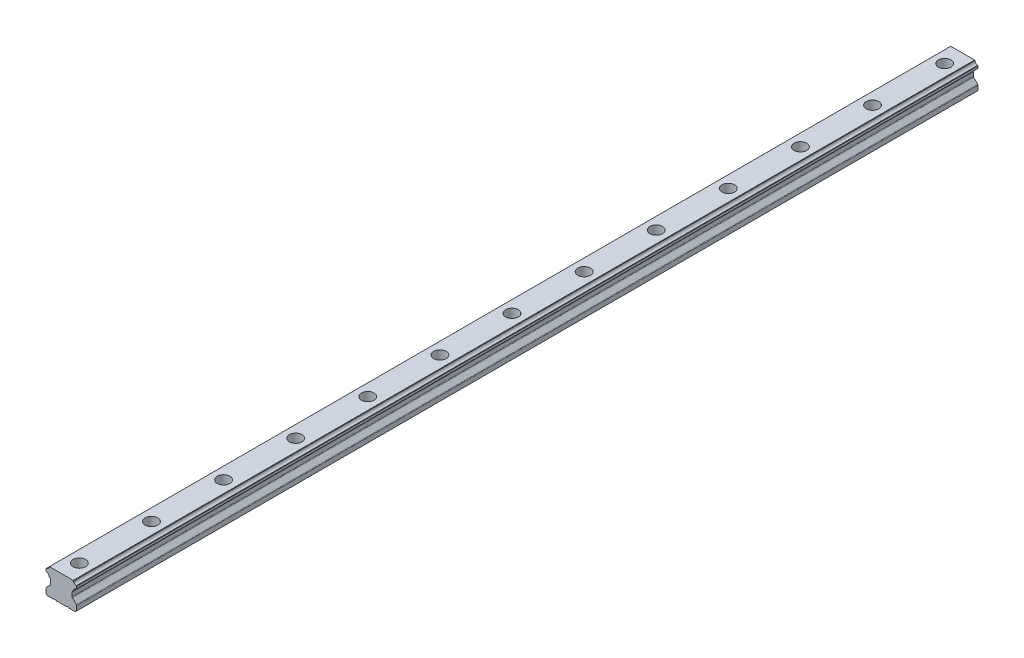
ISO-10303-21;
HEADER;
FILE_DESCRIPTION(('STEP AP214'),'2;1');
FILE_NAME('part.step','',(''),(''),'','','');
FILE_SCHEMA(('AUTOMOTIVE_DESIGN { 1 0 10303 214 1 1 1 1 }'));
ENDSEC;
DATA;
#1=APPLICATION_CONTEXT('core data for automotive mechanical design processes');
#2=APPLICATION_PROTOCOL_DEFINITION('international standard','automotive_design',2000,#1);
#3=PRODUCT_CONTEXT('',#1,'mechanical');
#4=PRODUCT('Part','Part','',(#3));
#5=PRODUCT_RELATED_PRODUCT_CATEGORY('part','',(#4));
#6=PRODUCT_DEFINITION_FORMATION('','',#4);
#7=PRODUCT_DEFINITION_CONTEXT('part definition',#1,'design');
#8=PRODUCT_DEFINITION('design','',#6,#7);
#9=PRODUCT_DEFINITION_SHAPE('','',#8);
#10=(LENGTH_UNIT() NAMED_UNIT(*) SI_UNIT(.MILLI.,.METRE.));
#11=(NAMED_UNIT(*) PLANE_ANGLE_UNIT() SI_UNIT($,.RADIAN.));
#12=(NAMED_UNIT(*) SI_UNIT($,.STERADIAN.) SOLID_ANGLE_UNIT());
#13=UNCERTAINTY_MEASURE_WITH_UNIT(LENGTH_MEASURE(1.E-05),#10,'distance_accuracy_value','');
#14=(GEOMETRIC_REPRESENTATION_CONTEXT(3) GLOBAL_UNCERTAINTY_ASSIGNED_CONTEXT((#13)) GLOBAL_UNIT_ASSIGNED_CONTEXT((#10,
#11,#12)) REPRESENTATION_CONTEXT('',''));
#15=CARTESIAN_POINT('',(0.,0.,0.));
#16=DIRECTION('',(0.,0.,1.));
#17=DIRECTION('',(1.,0.,0.));
#18=AXIS2_PLACEMENT_3D('',#15,#16,#17);
#19=CARTESIAN_POINT('',(13.5159523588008,14.8798688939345,1000.));
#20=DIRECTION('',(0.,-1.,0.));
#21=DIRECTION('',(0.,0.,-1.));
#22=AXIS2_PLACEMENT_3D('',#19,#20,#21);
#23=PLANE('',#22);
#24=CARTESIAN_POINT('',(0.264531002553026,14.8798688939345,260.));
#25=DIRECTION('',(0.,1.,0.));
#26=DIRECTION('',(0.,0.,1.));
#27=AXIS2_PLACEMENT_3D('',#24,#25,#26);
#28=CIRCLE('',#27,7.);
#29=CARTESIAN_POINT('',(0.264531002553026,14.8798688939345,267.));
#30=VERTEX_POINT('',#29);
#31=EDGE_CURVE('E1518',#30,#30,#28,.T.);
#32=ORIENTED_EDGE('',*,*,#31,.F.);
#33=EDGE_LOOP('',(#32));
#34=FACE_BOUND('',#33,.T.);
#35=CARTESIAN_POINT('',(0.264531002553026,14.8798688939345,339.999999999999));
#36=DIRECTION('',(0.,1.,0.));
#37=DIRECTION('',(0.,0.,1.));
#38=AXIS2_PLACEMENT_3D('',#35,#36,#37);
#39=CIRCLE('',#38,7.);
#40=CARTESIAN_POINT('',(0.264531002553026,14.8798688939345,346.999999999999));
#41=VERTEX_POINT('',#40);
#42=EDGE_CURVE('E1534',#41,#41,#39,.T.);
#43=ORIENTED_EDGE('',*,*,#42,.F.);
#44=EDGE_LOOP('',(#43));
#45=FACE_BOUND('',#44,.T.);
#46=CARTESIAN_POINT('',(0.264531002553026,14.8798688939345,419.999999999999));
#47=DIRECTION('',(0.,1.,0.));
#48=DIRECTION('',(0.,0.,1.));
#49=AXIS2_PLACEMENT_3D('',#46,#47,#48);
#50=CIRCLE('',#49,7.);
#51=CARTESIAN_POINT('',(0.264531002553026,14.8798688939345,426.999999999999));
#52=VERTEX_POINT('',#51);
#53=EDGE_CURVE('E1550',#52,#52,#50,.T.);
#54=ORIENTED_EDGE('',*,*,#53,.F.);
#55=EDGE_LOOP('',(#54));
#56=FACE_BOUND('',#55,.T.);
#57=CARTESIAN_POINT('',(0.264531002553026,14.8798688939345,499.999999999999));
#58=DIRECTION('',(0.,1.,0.));
#59=DIRECTION('',(0.,0.,1.));
#60=AXIS2_PLACEMENT_3D('',#57,#58,#59);
#61=CIRCLE('',#60,7.);
#62=CARTESIAN_POINT('',(0.264531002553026,14.8798688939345,506.999999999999));
#63=VERTEX_POINT('',#62);
#64=EDGE_CURVE('E1566',#63,#63,#61,.T.);
#65=ORIENTED_EDGE('',*,*,#64,.F.);
#66=EDGE_LOOP('',(#65));
#67=FACE_BOUND('',#66,.T.);
#68=CARTESIAN_POINT('',(0.264531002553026,14.8798688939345,579.999999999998));
#69=DIRECTION('',(0.,1.,0.));
#70=DIRECTION('',(0.,0.,1.));
#71=AXIS2_PLACEMENT_3D('',#68,#69,#70);
#72=CIRCLE('',#71,7.);
#73=CARTESIAN_POINT('',(0.264531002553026,14.8798688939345,586.999999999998));
#74=VERTEX_POINT('',#73);
#75=EDGE_CURVE('E1582',#74,#74,#72,.T.);
#76=ORIENTED_EDGE('',*,*,#75,.F.);
#77=EDGE_LOOP('',(#76));
#78=FACE_BOUND('',#77,.T.);
#79=CARTESIAN_POINT('',(0.264531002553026,14.8798688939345,659.999999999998));
#80=DIRECTION('',(0.,1.,0.));
#81=DIRECTION('',(0.,0.,1.));
#82=AXIS2_PLACEMENT_3D('',#79,#80,#81);
#83=CIRCLE('',#82,7.);
#84=CARTESIAN_POINT('',(0.264531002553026,14.8798688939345,666.999999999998));
#85=VERTEX_POINT('',#84);
#86=EDGE_CURVE('E1598',#85,#85,#83,.T.);
#87=ORIENTED_EDGE('',*,*,#86,.F.);
#88=EDGE_LOOP('',(#87));
#89=FACE_BOUND('',#88,.T.);
#90=CARTESIAN_POINT('',(0.264531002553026,14.8798688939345,739.999999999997));
#91=DIRECTION('',(0.,1.,0.));
#92=DIRECTION('',(0.,0.,1.));
#93=AXIS2_PLACEMENT_3D('',#90,#91,#92);
#94=CIRCLE('',#93,7.);
#95=CARTESIAN_POINT('',(0.264531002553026,14.8798688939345,746.999999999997));
#96=VERTEX_POINT('',#95);
#97=EDGE_CURVE('E1614',#96,#96,#94,.T.);
#98=ORIENTED_EDGE('',*,*,#97,.F.);
#99=EDGE_LOOP('',(#98));
#100=FACE_BOUND('',#99,.T.);
#101=CARTESIAN_POINT('',(0.264531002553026,14.8798688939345,819.999999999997));
#102=DIRECTION('',(0.,1.,0.));
#103=DIRECTION('',(0.,0.,1.));
#104=AXIS2_PLACEMENT_3D('',#101,#102,#103);
#105=CIRCLE('',#104,7.);
#106=CARTESIAN_POINT('',(0.264531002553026,14.8798688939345,826.999999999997));
#107=VERTEX_POINT('',#106);
#108=EDGE_CURVE('E1630',#107,#107,#105,.T.);
#109=ORIENTED_EDGE('',*,*,#108,.F.);
#110=EDGE_LOOP('',(#109));
#111=FACE_BOUND('',#110,.T.);
#112=CARTESIAN_POINT('',(0.264531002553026,14.8798688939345,899.999999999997));
#113=DIRECTION('',(0.,1.,0.));
#114=DIRECTION('',(0.,0.,1.));
#115=AXIS2_PLACEMENT_3D('',#112,#113,#114);
#116=CIRCLE('',#115,7.);
#117=CARTESIAN_POINT('',(0.264531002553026,14.8798688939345,906.999999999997));
#118=VERTEX_POINT('',#117);
#119=EDGE_CURVE('E1646',#118,#118,#116,.T.);
#120=ORIENTED_EDGE('',*,*,#119,.F.);
#121=EDGE_LOOP('',(#120));
#122=FACE_BOUND('',#121,.T.);
#123=CARTESIAN_POINT('',(0.26453100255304,14.8798688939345,979.999999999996));
#124=DIRECTION('',(0.,1.,0.));
#125=DIRECTION('',(0.,0.,1.));
#126=AXIS2_PLACEMENT_3D('',#123,#124,#125);
#127=CIRCLE('',#126,7.);
#128=CARTESIAN_POINT('',(0.26453100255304,14.8798688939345,986.999999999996));
#129=VERTEX_POINT('',#128);
#130=EDGE_CURVE('E1662',#129,#129,#127,.T.);
#131=ORIENTED_EDGE('',*,*,#130,.F.);
#132=EDGE_LOOP('',(#131));
#133=FACE_BOUND('',#132,.T.);
#134=CARTESIAN_POINT('',(0.264531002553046,14.8798688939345,20.));
#135=DIRECTION('',(0.,1.,0.));
#136=DIRECTION('',(0.,0.,1.));
#137=AXIS2_PLACEMENT_3D('',#134,#135,#136);
#138=CIRCLE('',#137,7.);
#139=CARTESIAN_POINT('',(0.264531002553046,14.8798688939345,27.));
#140=VERTEX_POINT('',#139);
#141=EDGE_CURVE('E1678',#140,#140,#138,.T.);
#142=ORIENTED_EDGE('',*,*,#141,.F.);
#143=EDGE_LOOP('',(#142));
#144=FACE_BOUND('',#143,.T.);
#145=DIRECTION('',(-1.,0.,0.));
#146=VECTOR('',#145,1.);
#147=CARTESIAN_POINT('',(13.5159523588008,14.8798688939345,0.));
#148=LINE('',#147,#146);
#149=CARTESIAN_POINT('',(13.5159523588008,14.8798688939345,0.));
#150=VERTEX_POINT('',#149);
#151=CARTESIAN_POINT('',(-12.986890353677,14.8798688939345,0.));
#152=VERTEX_POINT('',#151);
#153=EDGE_CURVE('E353',#150,#152,#148,.T.);
#154=ORIENTED_EDGE('',*,*,#153,.T.);
#155=DIRECTION('',(0.,0.,-1.));
#156=VECTOR('',#155,1.);
#157=CARTESIAN_POINT('',(-12.986890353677,14.8798688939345,1000.));
#158=LINE('',#157,#156);
#159=CARTESIAN_POINT('',(-12.986890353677,14.8798688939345,1000.));
#160=VERTEX_POINT('',#159);
#161=EDGE_CURVE('E547',#160,#152,#158,.T.);
#162=ORIENTED_EDGE('',*,*,#161,.F.);
#163=DIRECTION('',(-1.,0.,0.));
#164=VECTOR('',#163,1.);
#165=CARTESIAN_POINT('',(13.5159523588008,14.8798688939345,1000.));
#166=LINE('',#165,#164);
#167=CARTESIAN_POINT('',(13.5159523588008,14.8798688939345,1000.));
#168=VERTEX_POINT('',#167);
#169=EDGE_CURVE('E614',#168,#160,#166,.T.);
#170=ORIENTED_EDGE('',*,*,#169,.F.);
#171=DIRECTION('',(0.,0.,-1.));
#172=VECTOR('',#171,1.);
#173=CARTESIAN_POINT('',(13.5159523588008,14.8798688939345,1000.));
#174=LINE('',#173,#172);
#175=EDGE_CURVE('E551',#168,#150,#174,.T.);
#176=ORIENTED_EDGE('',*,*,#175,.T.);
#177=EDGE_LOOP('',(#154,#162,#170,#176));
#178=FACE_BOUND('',#177,.T.);
#179=CARTESIAN_POINT('',(0.264531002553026,14.8798688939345,180.));
#180=DIRECTION('',(0.,1.,0.));
#181=DIRECTION('',(0.,0.,1.));
#182=AXIS2_PLACEMENT_3D('',#179,#180,#181);
#183=CIRCLE('',#182,7.);
#184=CARTESIAN_POINT('',(0.264531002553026,14.8798688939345,187.));
#185=VERTEX_POINT('',#184);
#186=EDGE_CURVE('E1502',#185,#185,#183,.T.);
#187=ORIENTED_EDGE('',*,*,#186,.F.);
#188=EDGE_LOOP('',(#187));
#189=FACE_BOUND('',#188,.T.);
#190=CARTESIAN_POINT('',(0.264531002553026,14.8798688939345,100.));
#191=DIRECTION('',(0.,1.,0.));
#192=DIRECTION('',(0.,0.,1.));
#193=AXIS2_PLACEMENT_3D('',#190,#191,#192);
#194=CIRCLE('',#193,7.);
#195=CARTESIAN_POINT('',(0.264531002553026,14.8798688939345,107.));
#196=VERTEX_POINT('',#195);
#197=EDGE_CURVE('E1487',#196,#196,#194,.T.);
#198=ORIENTED_EDGE('',*,*,#197,.F.);
#199=EDGE_LOOP('',(#198));
#200=FACE_BOUND('',#199,.T.);
#201=ADVANCED_FACE('F45',(#34,#45,#56,#67,#78,#89,#100,#111,#122,#133,#144,#178,#189,#200),#23,.F.);
#202=CARTESIAN_POINT('',(13.3645310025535,3.02139126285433,1000.));
#203=DIRECTION('',(0.,0.,-1.));
#204=DIRECTION('',(-1.,0.,0.));
#205=AXIS2_PLACEMENT_3D('',#202,#203,#204);
#206=CYLINDRICAL_SURFACE('',#205,1.19999999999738);
#207=CARTESIAN_POINT('',(13.3645310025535,3.02139126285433,0.));
#208=DIRECTION('',(0.,0.,-1.));
#209=DIRECTION('',(1.,0.,0.));
#210=AXIS2_PLACEMENT_3D('',#207,#208,#209);
#211=CIRCLE('',#210,1.19999999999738);
#212=CARTESIAN_POINT('',(12.1645310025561,3.02139126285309,0.));
#213=VERTEX_POINT('',#212);
#214=CARTESIAN_POINT('',(12.5160028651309,3.86991940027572,0.));
#215=VERTEX_POINT('',#214);
#216=EDGE_CURVE('E327',#213,#215,#211,.T.);
#217=ORIENTED_EDGE('',*,*,#216,.T.);
#218=DIRECTION('',(0.,0.,-1.));
#219=VECTOR('',#218,1.);
#220=CARTESIAN_POINT('',(12.5160028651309,3.86991940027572,1000.));
#221=LINE('',#220,#219);
#222=CARTESIAN_POINT('',(12.5160028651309,3.86991940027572,1000.));
#223=VERTEX_POINT('',#222);
#224=EDGE_CURVE('E12',#223,#215,#221,.T.);
#225=ORIENTED_EDGE('',*,*,#224,.F.);
#226=CARTESIAN_POINT('',(13.3645310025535,3.02139126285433,1000.));
#227=DIRECTION('',(0.,0.,-1.));
#228=DIRECTION('',(1.,0.,0.));
#229=AXIS2_PLACEMENT_3D('',#226,#227,#228);
#230=CIRCLE('',#229,1.19999999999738);
#231=CARTESIAN_POINT('',(12.1645310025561,3.02139126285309,1000.));
#232=VERTEX_POINT('',#231);
#233=EDGE_CURVE('E440',#232,#223,#230,.T.);
#234=ORIENTED_EDGE('',*,*,#233,.F.);
#235=DIRECTION('',(0.,0.,-1.));
#236=VECTOR('',#235,1.);
#237=CARTESIAN_POINT('',(12.1645310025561,3.02139126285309,1000.));
#238=LINE('',#237,#236);
#239=EDGE_CURVE('E323',#232,#213,#238,.T.);
#240=ORIENTED_EDGE('',*,*,#239,.T.);
#241=EDGE_LOOP('',(#217,#225,#234,#240));
#242=FACE_BOUND('',#241,.T.);
#243=ADVANCED_FACE('F47',(#242),#206,.F.);
#244=CARTESIAN_POINT('',(12.5160028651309,3.86991940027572,1000.));
#245=DIRECTION('',(-0.707106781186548,0.707106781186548,0.));
#246=DIRECTION('',(-0.707106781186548,-0.707106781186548,0.));
#247=AXIS2_PLACEMENT_3D('',#244,#245,#246);
#248=PLANE('',#247);
#249=DIRECTION('',(0.707106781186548,0.707106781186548,0.));
#250=VECTOR('',#249,1.);
#251=CARTESIAN_POINT('',(12.5160028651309,3.86991940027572,0.));
#252=LINE('',#251,#250);
#253=CARTESIAN_POINT('',(13.890474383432,5.24439091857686,0.));
#254=VERTEX_POINT('',#253);
#255=EDGE_CURVE('E331',#215,#254,#252,.T.);
#256=ORIENTED_EDGE('',*,*,#255,.T.);
#257=DIRECTION('',(0.,0.,-1.));
#258=VECTOR('',#257,1.);
#259=CARTESIAN_POINT('',(13.890474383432,5.24439091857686,1000.));
#260=LINE('',#259,#258);
#261=CARTESIAN_POINT('',(13.890474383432,5.24439091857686,1000.));
#262=VERTEX_POINT('',#261);
#263=EDGE_CURVE('E55',#262,#254,#260,.T.);
#264=ORIENTED_EDGE('',*,*,#263,.F.);
#265=DIRECTION('',(0.707106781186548,0.707106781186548,0.));
#266=VECTOR('',#265,1.);
#267=CARTESIAN_POINT('',(12.5160028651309,3.86991940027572,1000.));
#268=LINE('',#267,#266);
#269=EDGE_CURVE('E196',#223,#262,#268,.T.);
#270=ORIENTED_EDGE('',*,*,#269,.F.);
#271=ORIENTED_EDGE('',*,*,#224,.T.);
#272=EDGE_LOOP('',(#256,#264,#270,#271));
#273=FACE_BOUND('',#272,.T.);
#274=ADVANCED_FACE('F721',(#273),#248,.F.);
#275=CARTESIAN_POINT('',(17.1321045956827,5.01129530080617,1000.));
#276=DIRECTION('',(0.,0.,-1.));
#277=DIRECTION('',(-1.,0.,0.));
#278=AXIS2_PLACEMENT_3D('',#275,#276,#277);
#279=CYLINDRICAL_SURFACE('',#278,3.25);
#280=CARTESIAN_POINT('',(17.1321045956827,5.01129530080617,0.));
#281=DIRECTION('',(0.,0.,-1.));
#282=DIRECTION('',(1.,0.,0.));
#283=AXIS2_PLACEMENT_3D('',#280,#281,#282);
#284=CIRCLE('',#283,3.25);
#285=CARTESIAN_POINT('',(16.8990089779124,8.25292551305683,0.));
#286=VERTEX_POINT('',#285);
#287=EDGE_CURVE('E335',#254,#286,#284,.T.);
#288=ORIENTED_EDGE('',*,*,#287,.T.);
#289=DIRECTION('',(0.,0.,-1.));
#290=VECTOR('',#289,1.);
#291=CARTESIAN_POINT('',(16.8990089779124,8.25292551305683,1000.));
#292=LINE('',#291,#290);
#293=CARTESIAN_POINT('',(16.8990089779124,8.25292551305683,1000.));
#294=VERTEX_POINT('',#293);
#295=EDGE_CURVE('E571',#294,#286,#292,.T.);
#296=ORIENTED_EDGE('',*,*,#295,.F.);
#297=CARTESIAN_POINT('',(17.1321045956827,5.01129530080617,1000.));
#298=DIRECTION('',(0.,0.,-1.));
#299=DIRECTION('',(1.,0.,0.));
#300=AXIS2_PLACEMENT_3D('',#297,#298,#299);
#301=CIRCLE('',#300,3.25);
#302=EDGE_CURVE('E581',#262,#294,#301,.T.);
#303=ORIENTED_EDGE('',*,*,#302,.F.);
#304=ORIENTED_EDGE('',*,*,#263,.T.);
#305=EDGE_LOOP('',(#288,#296,#303,#304));
#306=FACE_BOUND('',#305,.T.);
#307=ADVANCED_FACE('F579',(#306),#279,.F.);
#308=CARTESIAN_POINT('',(16.8990089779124,8.25292551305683,1000.));
#309=DIRECTION('',(-0.707106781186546,0.707106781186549,0.));
#310=DIRECTION('',(-0.707106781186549,-0.707106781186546,0.));
#311=AXIS2_PLACEMENT_3D('',#308,#309,#310);
#312=PLANE('',#311);
#313=DIRECTION('',(0.707106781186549,0.707106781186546,0.));
#314=VECTOR('',#313,1.);
#315=CARTESIAN_POINT('',(16.8990089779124,8.25292551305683,0.));
#316=LINE('',#315,#314);
#317=CARTESIAN_POINT('',(17.264531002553,8.6184475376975,0.));
#318=VERTEX_POINT('',#317);
#319=EDGE_CURVE('E338',#286,#318,#316,.T.);
#320=ORIENTED_EDGE('',*,*,#319,.T.);
#321=DIRECTION('',(0.,0.,-1.));
#322=VECTOR('',#321,1.);
#323=CARTESIAN_POINT('',(17.264531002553,8.6184475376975,1000.));
#324=LINE('',#323,#322);
#325=CARTESIAN_POINT('',(17.264531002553,8.6184475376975,1000.));
#326=VERTEX_POINT('',#325);
#327=EDGE_CURVE('E567',#326,#318,#324,.T.);
#328=ORIENTED_EDGE('',*,*,#327,.F.);
#329=DIRECTION('',(0.707106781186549,0.707106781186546,0.));
#330=VECTOR('',#329,1.);
#331=CARTESIAN_POINT('',(16.8990089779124,8.25292551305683,1000.));
#332=LINE('',#331,#330);
#333=EDGE_CURVE('E600',#294,#326,#332,.T.);
#334=ORIENTED_EDGE('',*,*,#333,.F.);
#335=ORIENTED_EDGE('',*,*,#295,.T.);
#336=EDGE_LOOP('',(#320,#328,#334,#335));
#337=FACE_BOUND('',#336,.T.);
#338=ADVANCED_FACE('F590',(#337),#312,.F.);
#339=CARTESIAN_POINT('',(17.264531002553,8.6184475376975,1000.));
#340=DIRECTION('',(-1.,0.,0.));
#341=DIRECTION('',(0.,0.,1.));
#342=AXIS2_PLACEMENT_3D('',#339,#340,#341);
#343=PLANE('',#342);
#344=DIRECTION('',(0.,1.,0.));
#345=VECTOR('',#344,1.);
#346=CARTESIAN_POINT('',(17.264531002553,8.6184475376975,0.));
#347=LINE('',#346,#345);
#348=CARTESIAN_POINT('',(17.264531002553,11.131290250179,0.));
#349=VERTEX_POINT('',#348);
#350=EDGE_CURVE('E341',#318,#349,#347,.T.);
#351=ORIENTED_EDGE('',*,*,#350,.T.);
#352=DIRECTION('',(0.,0.,-1.));
#353=VECTOR('',#352,1.);
#354=CARTESIAN_POINT('',(17.264531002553,11.131290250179,1000.));
#355=LINE('',#354,#353);
#356=CARTESIAN_POINT('',(17.264531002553,11.131290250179,1000.));
#357=VERTEX_POINT('',#356);
#358=EDGE_CURVE('E563',#357,#349,#355,.T.);
#359=ORIENTED_EDGE('',*,*,#358,.F.);
#360=DIRECTION('',(0.,1.,0.));
#361=VECTOR('',#360,1.);
#362=CARTESIAN_POINT('',(17.264531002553,8.6184475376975,1000.));
#363=LINE('',#362,#361);
#364=EDGE_CURVE('E596',#326,#357,#363,.T.);
#365=ORIENTED_EDGE('',*,*,#364,.F.);
#366=ORIENTED_EDGE('',*,*,#327,.T.);
#367=EDGE_LOOP('',(#351,#359,#365,#366));
#368=FACE_BOUND('',#367,.T.);
#369=ADVANCED_FACE('F594',(#368),#343,.F.);
#370=CARTESIAN_POINT('',(17.264531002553,11.131290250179,1000.));
#371=DIRECTION('',(-0.707106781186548,-0.707106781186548,0.));
#372=DIRECTION('',(0.707106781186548,-0.707106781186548,0.));
#373=AXIS2_PLACEMENT_3D('',#370,#371,#372);
#374=PLANE('',#373);
#375=DIRECTION('',(-0.707106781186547,0.707106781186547,0.));
#376=VECTOR('',#375,1.);
#377=CARTESIAN_POINT('',(17.264531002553,11.131290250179,0.));
#378=LINE('',#377,#376);
#379=CARTESIAN_POINT('',(16.8871331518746,11.5086881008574,0.));
#380=VERTEX_POINT('',#379);
#381=EDGE_CURVE('E344',#349,#380,#378,.T.);
#382=ORIENTED_EDGE('',*,*,#381,.T.);
#383=DIRECTION('',(0.,0.,-1.));
#384=VECTOR('',#383,1.);
#385=CARTESIAN_POINT('',(16.8871331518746,11.5086881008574,1000.));
#386=LINE('',#385,#384);
#387=CARTESIAN_POINT('',(16.8871331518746,11.5086881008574,1000.));
#388=VERTEX_POINT('',#387);
#389=EDGE_CURVE('E559',#388,#380,#386,.T.);
#390=ORIENTED_EDGE('',*,*,#389,.F.);
#391=DIRECTION('',(-0.707106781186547,0.707106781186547,0.));
#392=VECTOR('',#391,1.);
#393=CARTESIAN_POINT('',(17.264531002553,11.131290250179,1000.));
#394=LINE('',#393,#392);
#395=EDGE_CURVE('E599',#357,#388,#394,.T.);
#396=ORIENTED_EDGE('',*,*,#395,.F.);
#397=ORIENTED_EDGE('',*,*,#358,.T.);
#398=EDGE_LOOP('',(#382,#390,#396,#397));
#399=FACE_BOUND('',#398,.T.);
#400=ADVANCED_FACE('F735',(#399),#374,.F.);
#401=CARTESIAN_POINT('',(17.1321045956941,14.7494424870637,1000.));
#402=DIRECTION('',(0.,0.,-1.));
#403=DIRECTION('',(-1.,0.,0.));
#404=AXIS2_PLACEMENT_3D('',#401,#402,#403);
#405=CYLINDRICAL_SURFACE('',#404,3.25000000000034);
#406=CARTESIAN_POINT('',(17.1321045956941,14.7494424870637,0.));
#407=DIRECTION('',(0.,0.,-1.));
#408=DIRECTION('',(1.,0.,0.));
#409=AXIS2_PLACEMENT_3D('',#406,#407,#408);
#410=CIRCLE('',#409,3.25000000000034);
#411=CARTESIAN_POINT('',(13.8913502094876,14.5044710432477,0.));
#412=VERTEX_POINT('',#411);
#413=EDGE_CURVE('E347',#380,#412,#410,.T.);
#414=ORIENTED_EDGE('',*,*,#413,.T.);
#415=DIRECTION('',(0.,0.,-1.));
#416=VECTOR('',#415,1.);
#417=CARTESIAN_POINT('',(13.8913502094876,14.5044710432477,1000.));
#418=LINE('',#417,#416);
#419=CARTESIAN_POINT('',(13.8913502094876,14.5044710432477,1000.));
#420=VERTEX_POINT('',#419);
#421=EDGE_CURVE('E555',#420,#412,#418,.T.);
#422=ORIENTED_EDGE('',*,*,#421,.F.);
#423=CARTESIAN_POINT('',(17.1321045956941,14.7494424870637,1000.));
#424=DIRECTION('',(0.,0.,-1.));
#425=DIRECTION('',(1.,0.,0.));
#426=AXIS2_PLACEMENT_3D('',#423,#424,#425);
#427=CIRCLE('',#426,3.25000000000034);
#428=EDGE_CURVE('E604',#388,#420,#427,.T.);
#429=ORIENTED_EDGE('',*,*,#428,.F.);
#430=ORIENTED_EDGE('',*,*,#389,.T.);
#431=EDGE_LOOP('',(#414,#422,#429,#430));
#432=FACE_BOUND('',#431,.T.);
#433=ADVANCED_FACE('F731',(#432),#405,.F.);
#434=CARTESIAN_POINT('',(13.8913502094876,14.5044710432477,1000.));
#435=DIRECTION('',(-0.707106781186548,-0.707106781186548,0.));
#436=DIRECTION('',(0.707106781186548,-0.707106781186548,0.));
#437=AXIS2_PLACEMENT_3D('',#434,#435,#436);
#438=PLANE('',#437);
#439=DIRECTION('',(-0.707106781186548,0.707106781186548,0.));
#440=VECTOR('',#439,1.);
#441=CARTESIAN_POINT('',(13.8913502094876,14.5044710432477,0.));
#442=LINE('',#441,#440);
#443=EDGE_CURVE('E350',#412,#150,#442,.T.);
#444=ORIENTED_EDGE('',*,*,#443,.T.);
#445=ORIENTED_EDGE('',*,*,#175,.F.);
#446=DIRECTION('',(-0.707106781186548,0.707106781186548,0.));
#447=VECTOR('',#446,1.);
#448=CARTESIAN_POINT('',(13.8913502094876,14.5044710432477,1000.));
#449=LINE('',#448,#447);
#450=EDGE_CURVE('E611',#420,#168,#449,.T.);
#451=ORIENTED_EDGE('',*,*,#450,.F.);
#452=ORIENTED_EDGE('',*,*,#421,.T.);
#453=EDGE_LOOP('',(#444,#445,#451,#452));
#454=FACE_BOUND('',#453,.T.);
#455=ADVANCED_FACE('F728',(#454),#438,.F.);
#456=CARTESIAN_POINT('',(-12.986890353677,14.8798688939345,1000.));
#457=DIRECTION('',(0.707106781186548,-0.707106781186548,0.));
#458=DIRECTION('',(0.707106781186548,0.707106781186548,0.));
#459=AXIS2_PLACEMENT_3D('',#456,#457,#458);
#460=PLANE('',#459);
#461=DIRECTION('',(-0.707106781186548,-0.707106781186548,0.));
#462=VECTOR('',#461,1.);
#463=CARTESIAN_POINT('',(-12.986890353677,14.8798688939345,0.));
#464=LINE('',#463,#462);
#465=CARTESIAN_POINT('',(-13.3622882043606,14.5044710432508,0.));
#466=VERTEX_POINT('',#465);
#467=EDGE_CURVE('E356',#152,#466,#464,.T.);
#468=ORIENTED_EDGE('',*,*,#467,.T.);
#469=DIRECTION('',(0.,0.,-1.));
#470=VECTOR('',#469,1.);
#471=CARTESIAN_POINT('',(-13.3622882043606,14.5044710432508,1000.));
#472=LINE('',#471,#470);
#473=CARTESIAN_POINT('',(-13.3622882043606,14.5044710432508,1000.));
#474=VERTEX_POINT('',#473);
#475=EDGE_CURVE('E543',#474,#466,#472,.T.);
#476=ORIENTED_EDGE('',*,*,#475,.F.);
#477=DIRECTION('',(-0.707106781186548,-0.707106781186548,0.));
#478=VECTOR('',#477,1.);
#479=CARTESIAN_POINT('',(-12.986890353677,14.8798688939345,1000.));
#480=LINE('',#479,#478);
#481=EDGE_CURVE('E617',#160,#474,#480,.T.);
#482=ORIENTED_EDGE('',*,*,#481,.F.);
#483=ORIENTED_EDGE('',*,*,#161,.T.);
#484=EDGE_LOOP('',(#468,#476,#482,#483));
#485=FACE_BOUND('',#484,.T.);
#486=ADVANCED_FACE('F726',(#485),#460,.F.);
#487=CARTESIAN_POINT('',(-16.603042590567,14.749442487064,1000.));
#488=DIRECTION('',(0.,0.,-1.));
#489=DIRECTION('',(-1.,0.,0.));
#490=AXIS2_PLACEMENT_3D('',#487,#488,#489);
#491=CYLINDRICAL_SURFACE('',#490,3.24999999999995);
#492=CARTESIAN_POINT('',(-16.603042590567,14.749442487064,0.));
#493=DIRECTION('',(0.,0.,-1.));
#494=DIRECTION('',(1.,0.,0.));
#495=AXIS2_PLACEMENT_3D('',#492,#493,#494);
#496=CIRCLE('',#495,3.24999999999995);
#497=CARTESIAN_POINT('',(-16.3580711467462,11.5086881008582,0.));
#498=VERTEX_POINT('',#497);
#499=EDGE_CURVE('E359',#466,#498,#496,.T.);
#500=ORIENTED_EDGE('',*,*,#499,.T.);
#501=DIRECTION('',(0.,0.,-1.));
#502=VECTOR('',#501,1.);
#503=CARTESIAN_POINT('',(-16.3580711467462,11.5086881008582,1000.));
#504=LINE('',#503,#502);
#505=CARTESIAN_POINT('',(-16.3580711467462,11.5086881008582,1000.));
#506=VERTEX_POINT('',#505);
#507=EDGE_CURVE('E539',#506,#498,#504,.T.);
#508=ORIENTED_EDGE('',*,*,#507,.F.);
#509=CARTESIAN_POINT('',(-16.603042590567,14.749442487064,1000.));
#510=DIRECTION('',(0.,0.,-1.));
#511=DIRECTION('',(1.,0.,0.));
#512=AXIS2_PLACEMENT_3D('',#509,#510,#511);
#513=CIRCLE('',#512,3.24999999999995);
#514=EDGE_CURVE('E620',#474,#506,#513,.T.);
#515=ORIENTED_EDGE('',*,*,#514,.F.);
#516=ORIENTED_EDGE('',*,*,#475,.T.);
#517=EDGE_LOOP('',(#500,#508,#515,#516));
#518=FACE_BOUND('',#517,.T.);
#519=ADVANCED_FACE('F780',(#518),#491,.F.);
#520=CARTESIAN_POINT('',(-16.3580711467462,11.5086881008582,1000.));
#521=DIRECTION('',(0.707106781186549,-0.707106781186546,0.));
#522=DIRECTION('',(0.707106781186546,0.707106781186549,0.));
#523=AXIS2_PLACEMENT_3D('',#520,#521,#522);
#524=PLANE('',#523);
#525=DIRECTION('',(-0.707106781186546,-0.707106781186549,0.));
#526=VECTOR('',#525,1.);
#527=CARTESIAN_POINT('',(-16.3580711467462,11.5086881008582,0.));
#528=LINE('',#527,#526);
#529=CARTESIAN_POINT('',(-16.7354689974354,11.1312902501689,0.));
#530=VERTEX_POINT('',#529);
#531=EDGE_CURVE('E362',#498,#530,#528,.T.);
#532=ORIENTED_EDGE('',*,*,#531,.T.);
#533=DIRECTION('',(0.,0.,-1.));
#534=VECTOR('',#533,1.);
#535=CARTESIAN_POINT('',(-16.7354689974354,11.1312902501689,1000.));
#536=LINE('',#535,#534);
#537=CARTESIAN_POINT('',(-16.7354689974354,11.1312902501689,1000.));
#538=VERTEX_POINT('',#537);
#539=EDGE_CURVE('E535',#538,#530,#536,.T.);
#540=ORIENTED_EDGE('',*,*,#539,.F.);
#541=DIRECTION('',(-0.707106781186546,-0.707106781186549,0.));
#542=VECTOR('',#541,1.);
#543=CARTESIAN_POINT('',(-16.3580711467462,11.5086881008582,1000.));
#544=LINE('',#543,#542);
#545=EDGE_CURVE('E623',#506,#538,#544,.T.);
#546=ORIENTED_EDGE('',*,*,#545,.F.);
#547=ORIENTED_EDGE('',*,*,#507,.T.);
#548=EDGE_LOOP('',(#532,#540,#546,#547));
#549=FACE_BOUND('',#548,.T.);
#550=ADVANCED_FACE('F787',(#549),#524,.F.);
#551=CARTESIAN_POINT('',(-16.7354689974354,11.1312902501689,1000.));
#552=DIRECTION('',(1.,0.,0.));
#553=DIRECTION('',(0.,0.,-1.));
#554=AXIS2_PLACEMENT_3D('',#551,#552,#553);
#555=PLANE('',#554);
#556=DIRECTION('',(0.,-1.,0.));
#557=VECTOR('',#556,1.);
#558=CARTESIAN_POINT('',(-16.7354689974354,11.1312902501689,0.));
#559=LINE('',#558,#557);
#560=CARTESIAN_POINT('',(-16.7354689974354,8.61844753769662,0.));
#561=VERTEX_POINT('',#560);
#562=EDGE_CURVE('E365',#530,#561,#559,.T.);
#563=ORIENTED_EDGE('',*,*,#562,.T.);
#564=DIRECTION('',(0.,0.,-1.));
#565=VECTOR('',#564,1.);
#566=CARTESIAN_POINT('',(-16.7354689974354,8.61844753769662,1000.));
#567=LINE('',#566,#565);
#568=CARTESIAN_POINT('',(-16.7354689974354,8.61844753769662,1000.));
#569=VERTEX_POINT('',#568);
#570=EDGE_CURVE('E531',#569,#561,#567,.T.);
#571=ORIENTED_EDGE('',*,*,#570,.F.);
#572=DIRECTION('',(0.,-1.,0.));
#573=VECTOR('',#572,1.);
#574=CARTESIAN_POINT('',(-16.7354689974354,11.1312902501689,1000.));
#575=LINE('',#574,#573);
#576=EDGE_CURVE('E626',#538,#569,#575,.T.);
#577=ORIENTED_EDGE('',*,*,#576,.F.);
#578=ORIENTED_EDGE('',*,*,#539,.T.);
#579=EDGE_LOOP('',(#563,#571,#577,#578));
#580=FACE_BOUND('',#579,.T.);
#581=ADVANCED_FACE('F794',(#580),#555,.F.);
#582=CARTESIAN_POINT('',(-16.7354689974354,8.61844753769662,1000.));
#583=DIRECTION('',(0.707106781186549,0.707106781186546,0.));
#584=DIRECTION('',(-0.707106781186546,0.707106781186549,0.));
#585=AXIS2_PLACEMENT_3D('',#582,#583,#584);
#586=PLANE('',#585);
#587=DIRECTION('',(0.707106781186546,-0.707106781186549,0.));
#588=VECTOR('',#587,1.);
#589=CARTESIAN_POINT('',(-16.7354689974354,8.61844753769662,0.));
#590=LINE('',#589,#588);
#591=CARTESIAN_POINT('',(-16.3699469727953,8.25292551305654,0.));
#592=VERTEX_POINT('',#591);
#593=EDGE_CURVE('E368',#561,#592,#590,.T.);
#594=ORIENTED_EDGE('',*,*,#593,.T.);
#595=DIRECTION('',(0.,0.,-1.));
#596=VECTOR('',#595,1.);
#597=CARTESIAN_POINT('',(-16.3699469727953,8.25292551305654,1000.));
#598=LINE('',#597,#596);
#599=CARTESIAN_POINT('',(-16.3699469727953,8.25292551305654,1000.));
#600=VERTEX_POINT('',#599);
#601=EDGE_CURVE('E527',#600,#592,#598,.T.);
#602=ORIENTED_EDGE('',*,*,#601,.F.);
#603=DIRECTION('',(0.707106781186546,-0.707106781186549,0.));
#604=VECTOR('',#603,1.);
#605=CARTESIAN_POINT('',(-16.7354689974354,8.61844753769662,1000.));
#606=LINE('',#605,#604);
#607=EDGE_CURVE('E629',#569,#600,#606,.T.);
#608=ORIENTED_EDGE('',*,*,#607,.F.);
#609=ORIENTED_EDGE('',*,*,#570,.T.);
#610=EDGE_LOOP('',(#594,#602,#608,#609));
#611=FACE_BOUND('',#610,.T.);
#612=ADVANCED_FACE('F802',(#611),#586,.F.);
#613=CARTESIAN_POINT('',(-16.6030425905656,5.01129530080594,1000.));
#614=DIRECTION('',(0.,0.,-1.));
#615=DIRECTION('',(-1.,0.,0.));
#616=AXIS2_PLACEMENT_3D('',#613,#614,#615);
#617=CYLINDRICAL_SURFACE('',#616,3.24999999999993);
#618=CARTESIAN_POINT('',(-16.6030425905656,5.01129530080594,0.));
#619=DIRECTION('',(0.,0.,-1.));
#620=DIRECTION('',(1.,0.,0.));
#621=AXIS2_PLACEMENT_3D('',#618,#619,#620);
#622=CIRCLE('',#621,3.24999999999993);
#623=CARTESIAN_POINT('',(-13.3614123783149,5.2443909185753,0.));
#624=VERTEX_POINT('',#623);
#625=EDGE_CURVE('E371',#592,#624,#622,.T.);
#626=ORIENTED_EDGE('',*,*,#625,.T.);
#627=DIRECTION('',(0.,0.,-1.));
#628=VECTOR('',#627,1.);
#629=CARTESIAN_POINT('',(-13.3614123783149,5.2443909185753,1000.));
#630=LINE('',#629,#628);
#631=CARTESIAN_POINT('',(-13.3614123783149,5.2443909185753,1000.));
#632=VERTEX_POINT('',#631);
#633=EDGE_CURVE('E523',#632,#624,#630,.T.);
#634=ORIENTED_EDGE('',*,*,#633,.F.);
#635=CARTESIAN_POINT('',(-16.6030425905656,5.01129530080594,1000.));
#636=DIRECTION('',(0.,0.,-1.));
#637=DIRECTION('',(1.,0.,0.));
#638=AXIS2_PLACEMENT_3D('',#635,#636,#637);
#639=CIRCLE('',#638,3.24999999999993);
#640=EDGE_CURVE('E632',#600,#632,#639,.T.);
#641=ORIENTED_EDGE('',*,*,#640,.F.);
#642=ORIENTED_EDGE('',*,*,#601,.T.);
#643=EDGE_LOOP('',(#626,#634,#641,#642));
#644=FACE_BOUND('',#643,.T.);
#645=ADVANCED_FACE('F810',(#644),#617,.F.);
#646=CARTESIAN_POINT('',(-13.3614123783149,5.2443909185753,1000.));
#647=DIRECTION('',(0.707106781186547,0.707106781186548,0.));
#648=DIRECTION('',(-0.707106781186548,0.707106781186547,0.));
#649=AXIS2_PLACEMENT_3D('',#646,#647,#648);
#650=PLANE('',#649);
#651=DIRECTION('',(0.707106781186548,-0.707106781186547,0.));
#652=VECTOR('',#651,1.);
#653=CARTESIAN_POINT('',(-13.3614123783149,5.2443909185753,0.));
#654=LINE('',#653,#652);
#655=CARTESIAN_POINT('',(-11.986940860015,3.86991940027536,0.));
#656=VERTEX_POINT('',#655);
#657=EDGE_CURVE('E374',#624,#656,#654,.T.);
#658=ORIENTED_EDGE('',*,*,#657,.T.);
#659=DIRECTION('',(0.,0.,-1.));
#660=VECTOR('',#659,1.);
#661=CARTESIAN_POINT('',(-11.986940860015,3.86991940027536,1000.));
#662=LINE('',#661,#660);
#663=CARTESIAN_POINT('',(-11.986940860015,3.86991940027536,1000.));
#664=VERTEX_POINT('',#663);
#665=EDGE_CURVE('E519',#664,#656,#662,.T.);
#666=ORIENTED_EDGE('',*,*,#665,.F.);
#667=DIRECTION('',(0.707106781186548,-0.707106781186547,0.));
#668=VECTOR('',#667,1.);
#669=CARTESIAN_POINT('',(-13.3614123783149,5.2443909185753,1000.));
#670=LINE('',#669,#668);
#671=EDGE_CURVE('E635',#632,#664,#670,.T.);
#672=ORIENTED_EDGE('',*,*,#671,.F.);
#673=ORIENTED_EDGE('',*,*,#633,.T.);
#674=EDGE_LOOP('',(#658,#666,#672,#673));
#675=FACE_BOUND('',#674,.T.);
#676=ADVANCED_FACE('F818',(#675),#650,.F.);
#677=CARTESIAN_POINT('',(-12.8354689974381,3.02139126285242,1000.));
#678=DIRECTION('',(0.,0.,-1.));
#679=DIRECTION('',(-1.,0.,0.));
#680=AXIS2_PLACEMENT_3D('',#677,#678,#679);
#681=CYLINDRICAL_SURFACE('',#680,1.19999999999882);
#682=CARTESIAN_POINT('',(-12.8354689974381,3.02139126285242,0.));
#683=DIRECTION('',(0.,0.,-1.));
#684=DIRECTION('',(1.,0.,0.));
#685=AXIS2_PLACEMENT_3D('',#682,#683,#684);
#686=CIRCLE('',#685,1.19999999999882);
#687=CARTESIAN_POINT('',(-11.6354689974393,3.02139126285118,0.));
#688=VERTEX_POINT('',#687);
#689=EDGE_CURVE('E377',#656,#688,#686,.T.);
#690=ORIENTED_EDGE('',*,*,#689,.T.);
#691=DIRECTION('',(0.,0.,-1.));
#692=VECTOR('',#691,1.);
#693=CARTESIAN_POINT('',(-11.6354689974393,3.02139126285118,1000.));
#694=LINE('',#693,#692);
#695=CARTESIAN_POINT('',(-11.6354689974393,3.02139126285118,1000.));
#696=VERTEX_POINT('',#695);
#697=EDGE_CURVE('E515',#696,#688,#694,.T.);
#698=ORIENTED_EDGE('',*,*,#697,.F.);
#699=CARTESIAN_POINT('',(-12.8354689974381,3.02139126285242,1000.));
#700=DIRECTION('',(0.,0.,-1.));
#701=DIRECTION('',(1.,0.,0.));
#702=AXIS2_PLACEMENT_3D('',#699,#700,#701);
#703=CIRCLE('',#702,1.19999999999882);
#704=EDGE_CURVE('E638',#664,#696,#703,.T.);
#705=ORIENTED_EDGE('',*,*,#704,.F.);
#706=ORIENTED_EDGE('',*,*,#665,.T.);
#707=EDGE_LOOP('',(#690,#698,#705,#706));
#708=FACE_BOUND('',#707,.T.);
#709=ADVANCED_FACE('F826',(#708),#681,.F.);
#710=CARTESIAN_POINT('',(-11.6354689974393,3.02139126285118,1000.));
#711=DIRECTION('',(1.,0.,0.));
#712=DIRECTION('',(0.,0.,-1.));
#713=AXIS2_PLACEMENT_3D('',#710,#711,#712);
#714=PLANE('',#713);
#715=DIRECTION('',(0.,-1.,0.));
#716=VECTOR('',#715,1.);
#717=CARTESIAN_POINT('',(-11.6354689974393,3.02139126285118,0.));
#718=LINE('',#717,#716);
#719=CARTESIAN_POINT('',(-11.6354689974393,-1.38167320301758,0.));
#720=VERTEX_POINT('',#719);
#721=EDGE_CURVE('E380',#688,#720,#718,.T.);
#722=ORIENTED_EDGE('',*,*,#721,.T.);
#723=DIRECTION('',(0.,0.,-1.));
#724=VECTOR('',#723,1.);
#725=CARTESIAN_POINT('',(-11.6354689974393,-1.38167320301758,1000.));
#726=LINE('',#725,#724);
#727=CARTESIAN_POINT('',(-11.6354689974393,-1.38167320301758,1000.));
#728=VERTEX_POINT('',#727);
#729=EDGE_CURVE('E511',#728,#720,#726,.T.);
#730=ORIENTED_EDGE('',*,*,#729,.F.);
#731=DIRECTION('',(0.,-1.,0.));
#732=VECTOR('',#731,1.);
#733=CARTESIAN_POINT('',(-11.6354689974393,3.02139126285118,1000.));
#734=LINE('',#733,#732);
#735=EDGE_CURVE('E641',#696,#728,#734,.T.);
#736=ORIENTED_EDGE('',*,*,#735,.F.);
#737=ORIENTED_EDGE('',*,*,#697,.T.);
#738=EDGE_LOOP('',(#722,#730,#736,#737));
#739=FACE_BOUND('',#738,.T.);
#740=ADVANCED_FACE('F834',(#739),#714,.F.);
#741=CARTESIAN_POINT('',(-12.8354689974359,-1.38167320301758,1000.));
#742=DIRECTION('',(0.,0.,-1.));
#743=DIRECTION('',(-1.,0.,0.));
#744=AXIS2_PLACEMENT_3D('',#741,#742,#743);
#745=CYLINDRICAL_SURFACE('',#744,1.19999999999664);
#746=CARTESIAN_POINT('',(-12.8354689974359,-1.38167320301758,0.));
#747=DIRECTION('',(0.,0.,-1.));
#748=DIRECTION('',(1.,0.,0.));
#749=AXIS2_PLACEMENT_3D('',#746,#747,#748);
#750=CIRCLE('',#749,1.19999999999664);
#751=CARTESIAN_POINT('',(-11.9869408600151,-2.23020134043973,0.));
#752=VERTEX_POINT('',#751);
#753=EDGE_CURVE('E383',#720,#752,#750,.T.);
#754=ORIENTED_EDGE('',*,*,#753,.T.);
#755=DIRECTION('',(0.,0.,-1.));
#756=VECTOR('',#755,1.);
#757=CARTESIAN_POINT('',(-11.9869408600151,-2.23020134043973,1000.));
#758=LINE('',#757,#756);
#759=CARTESIAN_POINT('',(-11.9869408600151,-2.23020134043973,1000.));
#760=VERTEX_POINT('',#759);
#761=EDGE_CURVE('E507',#760,#752,#758,.T.);
#762=ORIENTED_EDGE('',*,*,#761,.F.);
#763=CARTESIAN_POINT('',(-12.8354689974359,-1.38167320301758,1000.));
#764=DIRECTION('',(0.,0.,-1.));
#765=DIRECTION('',(1.,0.,0.));
#766=AXIS2_PLACEMENT_3D('',#763,#764,#765);
#767=CIRCLE('',#766,1.19999999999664);
#768=EDGE_CURVE('E644',#728,#760,#767,.T.);
#769=ORIENTED_EDGE('',*,*,#768,.F.);
#770=ORIENTED_EDGE('',*,*,#729,.T.);
#771=EDGE_LOOP('',(#754,#762,#769,#770));
#772=FACE_BOUND('',#771,.T.);
#773=ADVANCED_FACE('F842',(#772),#745,.F.);
#774=CARTESIAN_POINT('',(-11.9869408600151,-2.23020134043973,1000.));
#775=DIRECTION('',(0.707106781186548,-0.707106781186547,0.));
#776=DIRECTION('',(0.707106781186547,0.707106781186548,0.));
#777=AXIS2_PLACEMENT_3D('',#774,#775,#776);
#778=PLANE('',#777);
#779=DIRECTION('',(-0.707106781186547,-0.707106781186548,0.));
#780=VECTOR('',#779,1.);
#781=CARTESIAN_POINT('',(-11.9869408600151,-2.23020134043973,0.));
#782=LINE('',#781,#780);
#783=CARTESIAN_POINT('',(-16.3839971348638,-6.62725761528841,0.));
#784=VERTEX_POINT('',#783);
#785=EDGE_CURVE('E386',#752,#784,#782,.T.);
#786=ORIENTED_EDGE('',*,*,#785,.T.);
#787=DIRECTION('',(0.,0.,-1.));
#788=VECTOR('',#787,1.);
#789=CARTESIAN_POINT('',(-16.3839971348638,-6.62725761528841,1000.));
#790=LINE('',#789,#788);
#791=CARTESIAN_POINT('',(-16.3839971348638,-6.62725761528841,1000.));
#792=VERTEX_POINT('',#791);
#793=EDGE_CURVE('E503',#792,#784,#790,.T.);
#794=ORIENTED_EDGE('',*,*,#793,.F.);
#795=DIRECTION('',(-0.707106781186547,-0.707106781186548,0.));
#796=VECTOR('',#795,1.);
#797=CARTESIAN_POINT('',(-11.9869408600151,-2.23020134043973,1000.));
#798=LINE('',#797,#796);
#799=EDGE_CURVE('E647',#760,#792,#798,.T.);
#800=ORIENTED_EDGE('',*,*,#799,.F.);
#801=ORIENTED_EDGE('',*,*,#761,.T.);
#802=EDGE_LOOP('',(#786,#794,#800,#801));
#803=FACE_BOUND('',#802,.T.);
#804=ADVANCED_FACE('F850',(#803),#778,.F.);
#805=CARTESIAN_POINT('',(-15.5354689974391,-7.47578575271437,1000.));
#806=DIRECTION('',(0.,0.,-1.));
#807=DIRECTION('',(-1.,0.,0.));
#808=AXIS2_PLACEMENT_3D('',#805,#806,#807);
#809=CYLINDRICAL_SURFACE('',#808,1.20000000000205);
#810=CARTESIAN_POINT('',(-15.5354689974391,-7.47578575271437,0.));
#811=DIRECTION('',(0.,0.,1.));
#812=DIRECTION('',(1.,0.,0.));
#813=AXIS2_PLACEMENT_3D('',#810,#811,#812);
#814=CIRCLE('',#813,1.20000000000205);
#815=CARTESIAN_POINT('',(-16.7354689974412,-7.47578575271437,0.));
#816=VERTEX_POINT('',#815);
#817=EDGE_CURVE('E389',#784,#816,#814,.T.);
#818=ORIENTED_EDGE('',*,*,#817,.T.);
#819=DIRECTION('',(0.,0.,-1.));
#820=VECTOR('',#819,1.);
#821=CARTESIAN_POINT('',(-16.7354689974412,-7.47578575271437,1000.));
#822=LINE('',#821,#820);
#823=CARTESIAN_POINT('',(-16.7354689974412,-7.47578575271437,1000.));
#824=VERTEX_POINT('',#823);
#825=EDGE_CURVE('E499',#824,#816,#822,.T.);
#826=ORIENTED_EDGE('',*,*,#825,.F.);
#827=CARTESIAN_POINT('',(-15.5354689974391,-7.47578575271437,1000.));
#828=DIRECTION('',(0.,0.,1.));
#829=DIRECTION('',(1.,0.,0.));
#830=AXIS2_PLACEMENT_3D('',#827,#828,#829);
#831=CIRCLE('',#830,1.20000000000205);
#832=EDGE_CURVE('E650',#792,#824,#831,.T.);
#833=ORIENTED_EDGE('',*,*,#832,.F.);
#834=ORIENTED_EDGE('',*,*,#793,.T.);
#835=EDGE_LOOP('',(#818,#826,#833,#834));
#836=FACE_BOUND('',#835,.T.);
#837=ADVANCED_FACE('F858',(#836),#809,.T.);
#838=CARTESIAN_POINT('',(-16.7354689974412,-7.47578575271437,1000.));
#839=DIRECTION('',(1.,0.,0.));
#840=DIRECTION('',(0.,0.,-1.));
#841=AXIS2_PLACEMENT_3D('',#838,#839,#840);
#842=PLANE('',#841);
#843=DIRECTION('',(0.,-1.,0.));
#844=VECTOR('',#843,1.);
#845=CARTESIAN_POINT('',(-16.7354689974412,-7.47578575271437,0.));
#846=LINE('',#845,#844);
#847=CARTESIAN_POINT('',(-16.7354689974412,-12.6201311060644,0.));
#848=VERTEX_POINT('',#847);
#849=EDGE_CURVE('E392',#816,#848,#846,.T.);
#850=ORIENTED_EDGE('',*,*,#849,.T.);
#851=DIRECTION('',(0.,0.,-1.));
#852=VECTOR('',#851,1.);
#853=CARTESIAN_POINT('',(-16.7354689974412,-12.6201311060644,1000.));
#854=LINE('',#853,#852);
#855=CARTESIAN_POINT('',(-16.7354689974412,-12.6201311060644,1000.));
#856=VERTEX_POINT('',#855);
#857=EDGE_CURVE('E495',#856,#848,#854,.T.);
#858=ORIENTED_EDGE('',*,*,#857,.F.);
#859=DIRECTION('',(0.,-1.,0.));
#860=VECTOR('',#859,1.);
#861=CARTESIAN_POINT('',(-16.7354689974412,-7.47578575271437,1000.));
#862=LINE('',#861,#860);
#863=EDGE_CURVE('E653',#824,#856,#862,.T.);
#864=ORIENTED_EDGE('',*,*,#863,.F.);
#865=ORIENTED_EDGE('',*,*,#825,.T.);
#866=EDGE_LOOP('',(#850,#858,#864,#865));
#867=FACE_BOUND('',#866,.T.);
#868=ADVANCED_FACE('F866',(#867),#842,.F.);
#869=CARTESIAN_POINT('',(-16.7354689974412,-12.6201311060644,1000.));
#870=DIRECTION('',(0.707106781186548,0.707106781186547,0.));
#871=DIRECTION('',(-0.707106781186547,0.707106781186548,0.));
#872=AXIS2_PLACEMENT_3D('',#869,#870,#871);
#873=PLANE('',#872);
#874=DIRECTION('',(0.707106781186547,-0.707106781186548,0.));
#875=VECTOR('',#874,1.);
#876=CARTESIAN_POINT('',(-16.7354689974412,-12.6201311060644,0.));
#877=LINE('',#876,#875);
#878=CARTESIAN_POINT('',(-15.2354689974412,-14.1201311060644,0.));
#879=VERTEX_POINT('',#878);
#880=EDGE_CURVE('E395',#848,#879,#877,.T.);
#881=ORIENTED_EDGE('',*,*,#880,.T.);
#882=DIRECTION('',(0.,0.,-1.));
#883=VECTOR('',#882,1.);
#884=CARTESIAN_POINT('',(-15.2354689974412,-14.1201311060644,1000.));
#885=LINE('',#884,#883);
#886=CARTESIAN_POINT('',(-15.2354689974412,-14.1201311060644,1000.));
#887=VERTEX_POINT('',#886);
#888=EDGE_CURVE('E491',#887,#879,#885,.T.);
#889=ORIENTED_EDGE('',*,*,#888,.F.);
#890=DIRECTION('',(0.707106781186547,-0.707106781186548,0.));
#891=VECTOR('',#890,1.);
#892=CARTESIAN_POINT('',(-16.7354689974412,-12.6201311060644,1000.));
#893=LINE('',#892,#891);
#894=EDGE_CURVE('E656',#856,#887,#893,.T.);
#895=ORIENTED_EDGE('',*,*,#894,.F.);
#896=ORIENTED_EDGE('',*,*,#857,.T.);
#897=EDGE_LOOP('',(#881,#889,#895,#896));
#898=FACE_BOUND('',#897,.T.);
#899=ADVANCED_FACE('F874',(#898),#873,.F.);
#900=CARTESIAN_POINT('',(-15.2354689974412,-14.1201311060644,1000.));
#901=DIRECTION('',(0.,1.,0.));
#902=DIRECTION('',(0.,0.,1.));
#903=AXIS2_PLACEMENT_3D('',#900,#901,#902);
#904=PLANE('',#903);
#905=DIRECTION('',(1.,0.,0.));
#906=VECTOR('',#905,1.);
#907=CARTESIAN_POINT('',(-15.2354689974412,-14.1201311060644,0.));
#908=LINE('',#907,#906);
#909=CARTESIAN_POINT('',(-8.48546899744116,-14.1201311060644,0.));
#910=VERTEX_POINT('',#909);
#911=EDGE_CURVE('E398',#879,#910,#908,.T.);
#912=ORIENTED_EDGE('',*,*,#911,.T.);
#913=DIRECTION('',(0.,0.,-1.));
#914=VECTOR('',#913,1.);
#915=CARTESIAN_POINT('',(-8.48546899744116,-14.1201311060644,1000.));
#916=LINE('',#915,#914);
#917=CARTESIAN_POINT('',(-8.48546899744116,-14.1201311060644,1000.));
#918=VERTEX_POINT('',#917);
#919=EDGE_CURVE('E487',#918,#910,#916,.T.);
#920=ORIENTED_EDGE('',*,*,#919,.F.);
#921=DIRECTION('',(1.,0.,0.));
#922=VECTOR('',#921,1.);
#923=CARTESIAN_POINT('',(-15.2354689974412,-14.1201311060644,1000.));
#924=LINE('',#923,#922);
#925=EDGE_CURVE('E659',#887,#918,#924,.T.);
#926=ORIENTED_EDGE('',*,*,#925,.F.);
#927=ORIENTED_EDGE('',*,*,#888,.T.);
#928=EDGE_LOOP('',(#912,#920,#926,#927));
#929=FACE_BOUND('',#928,.T.);
#930=ADVANCED_FACE('F882',(#929),#904,.F.);
#931=CARTESIAN_POINT('',(-8.48546899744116,-14.1201311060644,1000.));
#932=DIRECTION('',(-0.707106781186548,0.707106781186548,0.));
#933=DIRECTION('',(-0.707106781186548,-0.707106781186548,0.));
#934=AXIS2_PLACEMENT_3D('',#931,#932,#933);
#935=PLANE('',#934);
#936=DIRECTION('',(0.707106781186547,0.707106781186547,0.));
#937=VECTOR('',#936,1.);
#938=CARTESIAN_POINT('',(-8.48546899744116,-14.1201311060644,0.));
#939=LINE('',#938,#937);
#940=CARTESIAN_POINT('',(-7.98546899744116,-13.6201311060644,0.));
#941=VERTEX_POINT('',#940);
#942=EDGE_CURVE('E401',#910,#941,#939,.T.);
#943=ORIENTED_EDGE('',*,*,#942,.T.);
#944=DIRECTION('',(0.,0.,-1.));
#945=VECTOR('',#944,1.);
#946=CARTESIAN_POINT('',(-7.98546899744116,-13.6201311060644,1000.));
#947=LINE('',#946,#945);
#948=CARTESIAN_POINT('',(-7.98546899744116,-13.6201311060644,1000.));
#949=VERTEX_POINT('',#948);
#950=EDGE_CURVE('E483',#949,#941,#947,.T.);
#951=ORIENTED_EDGE('',*,*,#950,.F.);
#952=DIRECTION('',(0.707106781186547,0.707106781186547,0.));
#953=VECTOR('',#952,1.);
#954=CARTESIAN_POINT('',(-8.48546899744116,-14.1201311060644,1000.));
#955=LINE('',#954,#953);
#956=EDGE_CURVE('E662',#918,#949,#955,.T.);
#957=ORIENTED_EDGE('',*,*,#956,.F.);
#958=ORIENTED_EDGE('',*,*,#919,.T.);
#959=EDGE_LOOP('',(#943,#951,#957,#958));
#960=FACE_BOUND('',#959,.T.);
#961=ADVANCED_FACE('F890',(#960),#935,.F.);
#962=CARTESIAN_POINT('',(-7.98546899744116,-13.6201311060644,1000.));
#963=DIRECTION('',(0.,1.,0.));
#964=DIRECTION('',(0.,0.,1.));
#965=AXIS2_PLACEMENT_3D('',#962,#963,#964);
#966=PLANE('',#965);
#967=DIRECTION('',(1.,0.,0.));
#968=VECTOR('',#967,1.);
#969=CARTESIAN_POINT('',(-7.98546899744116,-13.6201311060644,0.));
#970=LINE('',#969,#968);
#971=CARTESIAN_POINT('',(-6.08546899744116,-13.6201311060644,0.));
#972=VERTEX_POINT('',#971);
#973=EDGE_CURVE('E404',#941,#972,#970,.T.);
#974=ORIENTED_EDGE('',*,*,#973,.T.);
#975=DIRECTION('',(0.,0.,-1.));
#976=VECTOR('',#975,1.);
#977=CARTESIAN_POINT('',(-6.08546899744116,-13.6201311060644,1000.));
#978=LINE('',#977,#976);
#979=CARTESIAN_POINT('',(-6.08546899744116,-13.6201311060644,1000.));
#980=VERTEX_POINT('',#979);
#981=EDGE_CURVE('E479',#980,#972,#978,.T.);
#982=ORIENTED_EDGE('',*,*,#981,.F.);
#983=DIRECTION('',(1.,0.,0.));
#984=VECTOR('',#983,1.);
#985=CARTESIAN_POINT('',(-7.98546899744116,-13.6201311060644,1000.));
#986=LINE('',#985,#984);
#987=EDGE_CURVE('E665',#949,#980,#986,.T.);
#988=ORIENTED_EDGE('',*,*,#987,.F.);
#989=ORIENTED_EDGE('',*,*,#950,.T.);
#990=EDGE_LOOP('',(#974,#982,#988,#989));
#991=FACE_BOUND('',#990,.T.);
#992=ADVANCED_FACE('F898',(#991),#966,.F.);
#993=CARTESIAN_POINT('',(-6.08546899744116,-13.6201311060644,1000.));
#994=DIRECTION('',(0.707106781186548,0.707106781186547,0.));
#995=DIRECTION('',(-0.707106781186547,0.707106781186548,0.));
#996=AXIS2_PLACEMENT_3D('',#993,#994,#995);
#997=PLANE('',#996);
#998=DIRECTION('',(0.707106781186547,-0.707106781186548,0.));
#999=VECTOR('',#998,1.);
#1000=CARTESIAN_POINT('',(-6.08546899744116,-13.6201311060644,0.));
#1001=LINE('',#1000,#999);
#1002=CARTESIAN_POINT('',(-5.58546899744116,-14.1201311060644,0.));
#1003=VERTEX_POINT('',#1002);
#1004=EDGE_CURVE('E407',#972,#1003,#1001,.T.);
#1005=ORIENTED_EDGE('',*,*,#1004,.T.);
#1006=DIRECTION('',(0.,0.,-1.));
#1007=VECTOR('',#1006,1.);
#1008=CARTESIAN_POINT('',(-5.58546899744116,-14.1201311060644,1000.));
#1009=LINE('',#1008,#1007);
#1010=CARTESIAN_POINT('',(-5.58546899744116,-14.1201311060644,1000.));
#1011=VERTEX_POINT('',#1010);
#1012=EDGE_CURVE('E475',#1011,#1003,#1009,.T.);
#1013=ORIENTED_EDGE('',*,*,#1012,.F.);
#1014=DIRECTION('',(0.707106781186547,-0.707106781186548,0.));
#1015=VECTOR('',#1014,1.);
#1016=CARTESIAN_POINT('',(-6.08546899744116,-13.6201311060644,1000.));
#1017=LINE('',#1016,#1015);
#1018=EDGE_CURVE('E668',#980,#1011,#1017,.T.);
#1019=ORIENTED_EDGE('',*,*,#1018,.F.);
#1020=ORIENTED_EDGE('',*,*,#981,.T.);
#1021=EDGE_LOOP('',(#1005,#1013,#1019,#1020));
#1022=FACE_BOUND('',#1021,.T.);
#1023=ADVANCED_FACE('F906',(#1022),#997,.F.);
#1024=CARTESIAN_POINT('',(-5.58546899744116,-14.1201311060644,1000.));
#1025=DIRECTION('',(0.,1.,0.));
#1026=DIRECTION('',(0.,0.,1.));
#1027=AXIS2_PLACEMENT_3D('',#1024,#1025,#1026);
#1028=PLANE('',#1027);
#1029=CARTESIAN_POINT('',(0.264531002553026,-14.1201311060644,100.));
#1030=DIRECTION('',(0.,1.,0.));
#1031=DIRECTION('',(0.,0.,1.));
#1032=AXIS2_PLACEMENT_3D('',#1029,#1030,#1031);
#1033=CIRCLE('',#1032,4.49999999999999);
#1034=CARTESIAN_POINT('',(0.264531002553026,-14.1201311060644,104.5));
#1035=VERTEX_POINT('',#1034);
#1036=EDGE_CURVE('E1498',#1035,#1035,#1033,.T.);
#1037=ORIENTED_EDGE('',*,*,#1036,.T.);
#1038=EDGE_LOOP('',(#1037));
#1039=FACE_BOUND('',#1038,.T.);
#1040=CARTESIAN_POINT('',(0.264531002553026,-14.1201311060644,180.));
#1041=DIRECTION('',(0.,1.,0.));
#1042=DIRECTION('',(0.,0.,1.));
#1043=AXIS2_PLACEMENT_3D('',#1040,#1041,#1042);
#1044=CIRCLE('',#1043,4.49999999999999);
#1045=CARTESIAN_POINT('',(0.264531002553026,-14.1201311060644,184.5));
#1046=VERTEX_POINT('',#1045);
#1047=EDGE_CURVE('E1514',#1046,#1046,#1044,.T.);
#1048=ORIENTED_EDGE('',*,*,#1047,.T.);
#1049=EDGE_LOOP('',(#1048));
#1050=FACE_BOUND('',#1049,.T.);
#1051=CARTESIAN_POINT('',(0.264531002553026,-14.1201311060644,260.));
#1052=DIRECTION('',(0.,1.,0.));
#1053=DIRECTION('',(0.,0.,1.));
#1054=AXIS2_PLACEMENT_3D('',#1051,#1052,#1053);
#1055=CIRCLE('',#1054,4.49999999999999);
#1056=CARTESIAN_POINT('',(0.264531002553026,-14.1201311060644,264.5));
#1057=VERTEX_POINT('',#1056);
#1058=EDGE_CURVE('E1530',#1057,#1057,#1055,.T.);
#1059=ORIENTED_EDGE('',*,*,#1058,.T.);
#1060=EDGE_LOOP('',(#1059));
#1061=FACE_BOUND('',#1060,.T.);
#1062=CARTESIAN_POINT('',(0.264531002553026,-14.1201311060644,339.999999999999));
#1063=DIRECTION('',(0.,1.,0.));
#1064=DIRECTION('',(0.,0.,1.));
#1065=AXIS2_PLACEMENT_3D('',#1062,#1063,#1064);
#1066=CIRCLE('',#1065,4.49999999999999);
#1067=CARTESIAN_POINT('',(0.264531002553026,-14.1201311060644,344.499999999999));
#1068=VERTEX_POINT('',#1067);
#1069=EDGE_CURVE('E1546',#1068,#1068,#1066,.T.);
#1070=ORIENTED_EDGE('',*,*,#1069,.T.);
#1071=EDGE_LOOP('',(#1070));
#1072=FACE_BOUND('',#1071,.T.);
#1073=CARTESIAN_POINT('',(0.264531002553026,-14.1201311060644,419.999999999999));
#1074=DIRECTION('',(0.,1.,0.));
#1075=DIRECTION('',(0.,0.,1.));
#1076=AXIS2_PLACEMENT_3D('',#1073,#1074,#1075);
#1077=CIRCLE('',#1076,4.49999999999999);
#1078=CARTESIAN_POINT('',(0.264531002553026,-14.1201311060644,424.499999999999));
#1079=VERTEX_POINT('',#1078);
#1080=EDGE_CURVE('E1562',#1079,#1079,#1077,.T.);
#1081=ORIENTED_EDGE('',*,*,#1080,.T.);
#1082=EDGE_LOOP('',(#1081));
#1083=FACE_BOUND('',#1082,.T.);
#1084=CARTESIAN_POINT('',(0.264531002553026,-14.1201311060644,499.999999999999));
#1085=DIRECTION('',(0.,1.,0.));
#1086=DIRECTION('',(0.,0.,1.));
#1087=AXIS2_PLACEMENT_3D('',#1084,#1085,#1086);
#1088=CIRCLE('',#1087,4.49999999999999);
#1089=CARTESIAN_POINT('',(0.264531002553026,-14.1201311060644,504.499999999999));
#1090=VERTEX_POINT('',#1089);
#1091=EDGE_CURVE('E1578',#1090,#1090,#1088,.T.);
#1092=ORIENTED_EDGE('',*,*,#1091,.T.);
#1093=EDGE_LOOP('',(#1092));
#1094=FACE_BOUND('',#1093,.T.);
#1095=CARTESIAN_POINT('',(0.264531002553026,-14.1201311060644,579.999999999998));
#1096=DIRECTION('',(0.,1.,0.));
#1097=DIRECTION('',(0.,0.,1.));
#1098=AXIS2_PLACEMENT_3D('',#1095,#1096,#1097);
#1099=CIRCLE('',#1098,4.49999999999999);
#1100=CARTESIAN_POINT('',(0.264531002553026,-14.1201311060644,584.499999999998));
#1101=VERTEX_POINT('',#1100);
#1102=EDGE_CURVE('E1594',#1101,#1101,#1099,.T.);
#1103=ORIENTED_EDGE('',*,*,#1102,.T.);
#1104=EDGE_LOOP('',(#1103));
#1105=FACE_BOUND('',#1104,.T.);
#1106=CARTESIAN_POINT('',(0.264531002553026,-14.1201311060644,659.999999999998));
#1107=DIRECTION('',(0.,1.,0.));
#1108=DIRECTION('',(0.,0.,1.));
#1109=AXIS2_PLACEMENT_3D('',#1106,#1107,#1108);
#1110=CIRCLE('',#1109,4.49999999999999);
#1111=CARTESIAN_POINT('',(0.264531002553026,-14.1201311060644,664.499999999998));
#1112=VERTEX_POINT('',#1111);
#1113=EDGE_CURVE('E1610',#1112,#1112,#1110,.T.);
#1114=ORIENTED_EDGE('',*,*,#1113,.T.);
#1115=EDGE_LOOP('',(#1114));
#1116=FACE_BOUND('',#1115,.T.);
#1117=CARTESIAN_POINT('',(0.264531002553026,-14.1201311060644,739.999999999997));
#1118=DIRECTION('',(0.,1.,0.));
#1119=DIRECTION('',(0.,0.,1.));
#1120=AXIS2_PLACEMENT_3D('',#1117,#1118,#1119);
#1121=CIRCLE('',#1120,4.49999999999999);
#1122=CARTESIAN_POINT('',(0.264531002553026,-14.1201311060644,744.499999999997));
#1123=VERTEX_POINT('',#1122);
#1124=EDGE_CURVE('E1626',#1123,#1123,#1121,.T.);
#1125=ORIENTED_EDGE('',*,*,#1124,.T.);
#1126=EDGE_LOOP('',(#1125));
#1127=FACE_BOUND('',#1126,.T.);
#1128=CARTESIAN_POINT('',(0.264531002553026,-14.1201311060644,819.999999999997));
#1129=DIRECTION('',(0.,1.,0.));
#1130=DIRECTION('',(0.,0.,1.));
#1131=AXIS2_PLACEMENT_3D('',#1128,#1129,#1130);
#1132=CIRCLE('',#1131,4.49999999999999);
#1133=CARTESIAN_POINT('',(0.264531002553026,-14.1201311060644,824.499999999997));
#1134=VERTEX_POINT('',#1133);
#1135=EDGE_CURVE('E1642',#1134,#1134,#1132,.T.);
#1136=ORIENTED_EDGE('',*,*,#1135,.T.);
#1137=EDGE_LOOP('',(#1136));
#1138=FACE_BOUND('',#1137,.T.);
#1139=CARTESIAN_POINT('',(0.264531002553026,-14.1201311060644,899.999999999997));
#1140=DIRECTION('',(0.,1.,0.));
#1141=DIRECTION('',(0.,0.,1.));
#1142=AXIS2_PLACEMENT_3D('',#1139,#1140,#1141);
#1143=CIRCLE('',#1142,4.49999999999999);
#1144=CARTESIAN_POINT('',(0.264531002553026,-14.1201311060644,904.499999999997));
#1145=VERTEX_POINT('',#1144);
#1146=EDGE_CURVE('E1658',#1145,#1145,#1143,.T.);
#1147=ORIENTED_EDGE('',*,*,#1146,.T.);
#1148=EDGE_LOOP('',(#1147));
#1149=FACE_BOUND('',#1148,.T.);
#1150=CARTESIAN_POINT('',(0.26453100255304,-14.1201311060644,979.999999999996));
#1151=DIRECTION('',(0.,1.,0.));
#1152=DIRECTION('',(0.,0.,1.));
#1153=AXIS2_PLACEMENT_3D('',#1150,#1151,#1152);
#1154=CIRCLE('',#1153,4.49999999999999);
#1155=CARTESIAN_POINT('',(0.26453100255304,-14.1201311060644,984.499999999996));
#1156=VERTEX_POINT('',#1155);
#1157=EDGE_CURVE('E1674',#1156,#1156,#1154,.T.);
#1158=ORIENTED_EDGE('',*,*,#1157,.T.);
#1159=EDGE_LOOP('',(#1158));
#1160=FACE_BOUND('',#1159,.T.);
#1161=CARTESIAN_POINT('',(0.264531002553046,-14.1201311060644,20.));
#1162=DIRECTION('',(0.,1.,0.));
#1163=DIRECTION('',(0.,0.,1.));
#1164=AXIS2_PLACEMENT_3D('',#1161,#1162,#1163);
#1165=CIRCLE('',#1164,4.49999999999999);
#1166=CARTESIAN_POINT('',(0.264531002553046,-14.1201311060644,24.5));
#1167=VERTEX_POINT('',#1166);
#1168=EDGE_CURVE('E332',#1167,#1167,#1165,.T.);
#1169=ORIENTED_EDGE('',*,*,#1168,.T.);
#1170=EDGE_LOOP('',(#1169));
#1171=FACE_BOUND('',#1170,.T.);
#1172=DIRECTION('',(1.,0.,0.));
#1173=VECTOR('',#1172,1.);
#1174=CARTESIAN_POINT('',(-5.58546899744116,-14.1201311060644,0.));
#1175=LINE('',#1174,#1173);
#1176=CARTESIAN_POINT('',(6.11453100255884,-14.1201311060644,0.));
#1177=VERTEX_POINT('',#1176);
#1178=EDGE_CURVE('E410',#1003,#1177,#1175,.T.);
#1179=ORIENTED_EDGE('',*,*,#1178,.T.);
#1180=DIRECTION('',(0.,0.,-1.));
#1181=VECTOR('',#1180,1.);
#1182=CARTESIAN_POINT('',(6.11453100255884,-14.1201311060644,1000.));
#1183=LINE('',#1182,#1181);
#1184=CARTESIAN_POINT('',(6.11453100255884,-14.1201311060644,1000.));
#1185=VERTEX_POINT('',#1184);
#1186=EDGE_CURVE('E471',#1185,#1177,#1183,.T.);
#1187=ORIENTED_EDGE('',*,*,#1186,.F.);
#1188=DIRECTION('',(1.,0.,0.));
#1189=VECTOR('',#1188,1.);
#1190=CARTESIAN_POINT('',(-5.58546899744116,-14.1201311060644,1000.));
#1191=LINE('',#1190,#1189);
#1192=EDGE_CURVE('E671',#1011,#1185,#1191,.T.);
#1193=ORIENTED_EDGE('',*,*,#1192,.F.);
#1194=ORIENTED_EDGE('',*,*,#1012,.T.);
#1195=EDGE_LOOP('',(#1179,#1187,#1193,#1194));
#1196=FACE_BOUND('',#1195,.T.);
#1197=ADVANCED_FACE('F914',(#1039,#1050,#1061,#1072,#1083,#1094,#1105,#1116,#1127,#1138,#1149,
#1160,#1171,#1196),#1028,.F.);
#1198=CARTESIAN_POINT('',(6.11453100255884,-14.1201311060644,1000.));
#1199=DIRECTION('',(-0.707106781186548,0.707106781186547,0.));
#1200=DIRECTION('',(-0.707106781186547,-0.707106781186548,0.));
#1201=AXIS2_PLACEMENT_3D('',#1198,#1199,#1200);
#1202=PLANE('',#1201);
#1203=DIRECTION('',(0.707106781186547,0.707106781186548,0.));
#1204=VECTOR('',#1203,1.);
#1205=CARTESIAN_POINT('',(6.11453100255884,-14.1201311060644,0.));
#1206=LINE('',#1205,#1204);
#1207=CARTESIAN_POINT('',(6.61453100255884,-13.6201311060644,0.));
#1208=VERTEX_POINT('',#1207);
#1209=EDGE_CURVE('E413',#1177,#1208,#1206,.T.);
#1210=ORIENTED_EDGE('',*,*,#1209,.T.);
#1211=DIRECTION('',(0.,0.,-1.));
#1212=VECTOR('',#1211,1.);
#1213=CARTESIAN_POINT('',(6.61453100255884,-13.6201311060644,1000.));
#1214=LINE('',#1213,#1212);
#1215=CARTESIAN_POINT('',(6.61453100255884,-13.6201311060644,1000.));
#1216=VERTEX_POINT('',#1215);
#1217=EDGE_CURVE('E467',#1216,#1208,#1214,.T.);
#1218=ORIENTED_EDGE('',*,*,#1217,.F.);
#1219=DIRECTION('',(0.707106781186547,0.707106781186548,0.));
#1220=VECTOR('',#1219,1.);
#1221=CARTESIAN_POINT('',(6.11453100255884,-14.1201311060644,1000.));
#1222=LINE('',#1221,#1220);
#1223=EDGE_CURVE('E674',#1185,#1216,#1222,.T.);
#1224=ORIENTED_EDGE('',*,*,#1223,.F.);
#1225=ORIENTED_EDGE('',*,*,#1186,.T.);
#1226=EDGE_LOOP('',(#1210,#1218,#1224,#1225));
#1227=FACE_BOUND('',#1226,.T.);
#1228=ADVANCED_FACE('F923',(#1227),#1202,.F.);
#1229=CARTESIAN_POINT('',(6.61453100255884,-13.6201311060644,1000.));
#1230=DIRECTION('',(0.,1.,0.));
#1231=DIRECTION('',(0.,0.,1.));
#1232=AXIS2_PLACEMENT_3D('',#1229,#1230,#1231);
#1233=PLANE('',#1232);
#1234=DIRECTION('',(1.,0.,0.));
#1235=VECTOR('',#1234,1.);
#1236=CARTESIAN_POINT('',(6.61453100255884,-13.6201311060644,0.));
#1237=LINE('',#1236,#1235);
#1238=CARTESIAN_POINT('',(8.51453100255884,-13.6201311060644,0.));
#1239=VERTEX_POINT('',#1238);
#1240=EDGE_CURVE('E416',#1208,#1239,#1237,.T.);
#1241=ORIENTED_EDGE('',*,*,#1240,.T.);
#1242=DIRECTION('',(0.,0.,-1.));
#1243=VECTOR('',#1242,1.);
#1244=CARTESIAN_POINT('',(8.51453100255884,-13.6201311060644,1000.));
#1245=LINE('',#1244,#1243);
#1246=CARTESIAN_POINT('',(8.51453100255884,-13.6201311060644,1000.));
#1247=VERTEX_POINT('',#1246);
#1248=EDGE_CURVE('E463',#1247,#1239,#1245,.T.);
#1249=ORIENTED_EDGE('',*,*,#1248,.F.);
#1250=DIRECTION('',(1.,0.,0.));
#1251=VECTOR('',#1250,1.);
#1252=CARTESIAN_POINT('',(6.61453100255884,-13.6201311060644,1000.));
#1253=LINE('',#1252,#1251);
#1254=EDGE_CURVE('E677',#1216,#1247,#1253,.T.);
#1255=ORIENTED_EDGE('',*,*,#1254,.F.);
#1256=ORIENTED_EDGE('',*,*,#1217,.T.);
#1257=EDGE_LOOP('',(#1241,#1249,#1255,#1256));
#1258=FACE_BOUND('',#1257,.T.);
#1259=ADVANCED_FACE('F931',(#1258),#1233,.F.);
#1260=CARTESIAN_POINT('',(8.51453100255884,-13.6201311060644,1000.));
#1261=DIRECTION('',(0.707106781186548,0.707106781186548,0.));
#1262=DIRECTION('',(-0.707106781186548,0.707106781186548,0.));
#1263=AXIS2_PLACEMENT_3D('',#1260,#1261,#1262);
#1264=PLANE('',#1263);
#1265=DIRECTION('',(0.707106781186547,-0.707106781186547,0.));
#1266=VECTOR('',#1265,1.);
#1267=CARTESIAN_POINT('',(8.51453100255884,-13.6201311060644,0.));
#1268=LINE('',#1267,#1266);
#1269=CARTESIAN_POINT('',(9.01453100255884,-14.1201311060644,0.));
#1270=VERTEX_POINT('',#1269);
#1271=EDGE_CURVE('E419',#1239,#1270,#1268,.T.);
#1272=ORIENTED_EDGE('',*,*,#1271,.T.);
#1273=DIRECTION('',(0.,0.,-1.));
#1274=VECTOR('',#1273,1.);
#1275=CARTESIAN_POINT('',(9.01453100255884,-14.1201311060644,1000.));
#1276=LINE('',#1275,#1274);
#1277=CARTESIAN_POINT('',(9.01453100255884,-14.1201311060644,1000.));
#1278=VERTEX_POINT('',#1277);
#1279=EDGE_CURVE('E459',#1278,#1270,#1276,.T.);
#1280=ORIENTED_EDGE('',*,*,#1279,.F.);
#1281=DIRECTION('',(0.707106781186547,-0.707106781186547,0.));
#1282=VECTOR('',#1281,1.);
#1283=CARTESIAN_POINT('',(8.51453100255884,-13.6201311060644,1000.));
#1284=LINE('',#1283,#1282);
#1285=EDGE_CURVE('E680',#1247,#1278,#1284,.T.);
#1286=ORIENTED_EDGE('',*,*,#1285,.F.);
#1287=ORIENTED_EDGE('',*,*,#1248,.T.);
#1288=EDGE_LOOP('',(#1272,#1280,#1286,#1287));
#1289=FACE_BOUND('',#1288,.T.);
#1290=ADVANCED_FACE('F939',(#1289),#1264,.F.);
#1291=CARTESIAN_POINT('',(9.01453100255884,-14.1201311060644,1000.));
#1292=DIRECTION('',(0.,1.,0.));
#1293=DIRECTION('',(0.,0.,1.));
#1294=AXIS2_PLACEMENT_3D('',#1291,#1292,#1293);
#1295=PLANE('',#1294);
#1296=DIRECTION('',(1.,0.,0.));
#1297=VECTOR('',#1296,1.);
#1298=CARTESIAN_POINT('',(9.01453100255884,-14.1201311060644,0.));
#1299=LINE('',#1298,#1297);
#1300=CARTESIAN_POINT('',(15.7645310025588,-14.1201311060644,0.));
#1301=VERTEX_POINT('',#1300);
#1302=EDGE_CURVE('E422',#1270,#1301,#1299,.T.);
#1303=ORIENTED_EDGE('',*,*,#1302,.T.);
#1304=DIRECTION('',(0.,0.,-1.));
#1305=VECTOR('',#1304,1.);
#1306=CARTESIAN_POINT('',(15.7645310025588,-14.1201311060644,1000.));
#1307=LINE('',#1306,#1305);
#1308=CARTESIAN_POINT('',(15.7645310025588,-14.1201311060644,1000.));
#1309=VERTEX_POINT('',#1308);
#1310=EDGE_CURVE('E455',#1309,#1301,#1307,.T.);
#1311=ORIENTED_EDGE('',*,*,#1310,.F.);
#1312=DIRECTION('',(1.,0.,0.));
#1313=VECTOR('',#1312,1.);
#1314=CARTESIAN_POINT('',(9.01453100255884,-14.1201311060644,1000.));
#1315=LINE('',#1314,#1313);
#1316=EDGE_CURVE('E683',#1278,#1309,#1315,.T.);
#1317=ORIENTED_EDGE('',*,*,#1316,.F.);
#1318=ORIENTED_EDGE('',*,*,#1279,.T.);
#1319=EDGE_LOOP('',(#1303,#1311,#1317,#1318));
#1320=FACE_BOUND('',#1319,.T.);
#1321=ADVANCED_FACE('F947',(#1320),#1295,.F.);
#1322=CARTESIAN_POINT('',(15.7645310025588,-14.1201311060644,1000.));
#1323=DIRECTION('',(-0.707106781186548,0.707106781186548,0.));
#1324=DIRECTION('',(-0.707106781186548,-0.707106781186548,0.));
#1325=AXIS2_PLACEMENT_3D('',#1322,#1323,#1324);
#1326=PLANE('',#1325);
#1327=DIRECTION('',(0.707106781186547,0.707106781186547,0.));
#1328=VECTOR('',#1327,1.);
#1329=CARTESIAN_POINT('',(15.7645310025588,-14.1201311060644,0.));
#1330=LINE('',#1329,#1328);
#1331=CARTESIAN_POINT('',(17.2645310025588,-12.6201311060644,0.));
#1332=VERTEX_POINT('',#1331);
#1333=EDGE_CURVE('E425',#1301,#1332,#1330,.T.);
#1334=ORIENTED_EDGE('',*,*,#1333,.T.);
#1335=DIRECTION('',(0.,0.,-1.));
#1336=VECTOR('',#1335,1.);
#1337=CARTESIAN_POINT('',(17.2645310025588,-12.6201311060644,1000.));
#1338=LINE('',#1337,#1336);
#1339=CARTESIAN_POINT('',(17.2645310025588,-12.6201311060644,1000.));
#1340=VERTEX_POINT('',#1339);
#1341=EDGE_CURVE('E451',#1340,#1332,#1338,.T.);
#1342=ORIENTED_EDGE('',*,*,#1341,.F.);
#1343=DIRECTION('',(0.707106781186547,0.707106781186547,0.));
#1344=VECTOR('',#1343,1.);
#1345=CARTESIAN_POINT('',(15.7645310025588,-14.1201311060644,1000.));
#1346=LINE('',#1345,#1344);
#1347=EDGE_CURVE('E686',#1309,#1340,#1346,.T.);
#1348=ORIENTED_EDGE('',*,*,#1347,.F.);
#1349=ORIENTED_EDGE('',*,*,#1310,.T.);
#1350=EDGE_LOOP('',(#1334,#1342,#1348,#1349));
#1351=FACE_BOUND('',#1350,.T.);
#1352=ADVANCED_FACE('F955',(#1351),#1326,.F.);
#1353=CARTESIAN_POINT('',(17.2645310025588,-12.6201311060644,1000.));
#1354=DIRECTION('',(-1.,0.,0.));
#1355=DIRECTION('',(0.,0.,1.));
#1356=AXIS2_PLACEMENT_3D('',#1353,#1354,#1355);
#1357=PLANE('',#1356);
#1358=DIRECTION('',(0.,1.,0.));
#1359=VECTOR('',#1358,1.);
#1360=CARTESIAN_POINT('',(17.2645310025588,-12.6201311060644,0.));
#1361=LINE('',#1360,#1359);
#1362=CARTESIAN_POINT('',(17.2645310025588,-7.47578575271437,0.));
#1363=VERTEX_POINT('',#1362);
#1364=EDGE_CURVE('E428',#1332,#1363,#1361,.T.);
#1365=ORIENTED_EDGE('',*,*,#1364,.T.);
#1366=DIRECTION('',(0.,0.,-1.));
#1367=VECTOR('',#1366,1.);
#1368=CARTESIAN_POINT('',(17.2645310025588,-7.47578575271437,1000.));
#1369=LINE('',#1368,#1367);
#1370=CARTESIAN_POINT('',(17.2645310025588,-7.47578575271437,1000.));
#1371=VERTEX_POINT('',#1370);
#1372=EDGE_CURVE('E447',#1371,#1363,#1369,.T.);
#1373=ORIENTED_EDGE('',*,*,#1372,.F.);
#1374=DIRECTION('',(0.,1.,0.));
#1375=VECTOR('',#1374,1.);
#1376=CARTESIAN_POINT('',(17.2645310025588,-12.6201311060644,1000.));
#1377=LINE('',#1376,#1375);
#1378=EDGE_CURVE('E689',#1340,#1371,#1377,.T.);
#1379=ORIENTED_EDGE('',*,*,#1378,.F.);
#1380=ORIENTED_EDGE('',*,*,#1341,.T.);
#1381=EDGE_LOOP('',(#1365,#1373,#1379,#1380));
#1382=FACE_BOUND('',#1381,.T.);
#1383=ADVANCED_FACE('F697',(#1382),#1357,.F.);
#1384=CARTESIAN_POINT('',(16.0645310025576,-7.47578575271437,1000.));
#1385=DIRECTION('',(0.,0.,-1.));
#1386=DIRECTION('',(-1.,0.,0.));
#1387=AXIS2_PLACEMENT_3D('',#1384,#1385,#1386);
#1388=CYLINDRICAL_SURFACE('',#1387,1.20000000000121);
#1389=CARTESIAN_POINT('',(16.0645310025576,-7.47578575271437,0.));
#1390=DIRECTION('',(0.,0.,1.));
#1391=DIRECTION('',(1.,0.,0.));
#1392=AXIS2_PLACEMENT_3D('',#1389,#1390,#1391);
#1393=CIRCLE('',#1392,1.20000000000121);
#1394=CARTESIAN_POINT('',(16.9130591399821,-6.6272576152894,0.));
#1395=VERTEX_POINT('',#1394);
#1396=EDGE_CURVE('E431',#1363,#1395,#1393,.T.);
#1397=ORIENTED_EDGE('',*,*,#1396,.T.);
#1398=DIRECTION('',(0.,0.,-1.));
#1399=VECTOR('',#1398,1.);
#1400=CARTESIAN_POINT('',(16.9130591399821,-6.6272576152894,1000.));
#1401=LINE('',#1400,#1399);
#1402=CARTESIAN_POINT('',(16.9130591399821,-6.6272576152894,1000.));
#1403=VERTEX_POINT('',#1402);
#1404=EDGE_CURVE('E316',#1403,#1395,#1401,.T.);
#1405=ORIENTED_EDGE('',*,*,#1404,.F.);
#1406=CARTESIAN_POINT('',(16.0645310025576,-7.47578575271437,1000.));
#1407=DIRECTION('',(0.,0.,1.));
#1408=DIRECTION('',(1.,0.,0.));
#1409=AXIS2_PLACEMENT_3D('',#1406,#1407,#1408);
#1410=CIRCLE('',#1409,1.20000000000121);
#1411=EDGE_CURVE('E305',#1371,#1403,#1410,.T.);
#1412=ORIENTED_EDGE('',*,*,#1411,.F.);
#1413=ORIENTED_EDGE('',*,*,#1372,.T.);
#1414=EDGE_LOOP('',(#1397,#1405,#1412,#1413));
#1415=FACE_BOUND('',#1414,.T.);
#1416=ADVANCED_FACE('F701',(#1415),#1388,.T.);
#1417=CARTESIAN_POINT('',(16.9130591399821,-6.6272576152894,1000.));
#1418=DIRECTION('',(-0.707106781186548,-0.707106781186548,0.));
#1419=DIRECTION('',(0.707106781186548,-0.707106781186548,0.));
#1420=AXIS2_PLACEMENT_3D('',#1417,#1418,#1419);
#1421=PLANE('',#1420);
#1422=DIRECTION('',(-0.707106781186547,0.707106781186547,0.));
#1423=VECTOR('',#1422,1.);
#1424=CARTESIAN_POINT('',(16.9130591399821,-6.6272576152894,0.));
#1425=LINE('',#1424,#1423);
#1426=CARTESIAN_POINT('',(12.516002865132,-2.23020134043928,0.));
#1427=VERTEX_POINT('',#1426);
#1428=EDGE_CURVE('E314',#1395,#1427,#1425,.T.);
#1429=ORIENTED_EDGE('',*,*,#1428,.T.);
#1430=DIRECTION('',(0.,0.,-1.));
#1431=VECTOR('',#1430,1.);
#1432=CARTESIAN_POINT('',(12.516002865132,-2.23020134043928,1000.));
#1433=LINE('',#1432,#1431);
#1434=CARTESIAN_POINT('',(12.516002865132,-2.23020134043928,1000.));
#1435=VERTEX_POINT('',#1434);
#1436=EDGE_CURVE('E311',#1435,#1427,#1433,.T.);
#1437=ORIENTED_EDGE('',*,*,#1436,.F.);
#1438=DIRECTION('',(-0.707106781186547,0.707106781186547,0.));
#1439=VECTOR('',#1438,1.);
#1440=CARTESIAN_POINT('',(16.9130591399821,-6.6272576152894,1000.));
#1441=LINE('',#1440,#1439);
#1442=EDGE_CURVE('E299',#1403,#1435,#1441,.T.);
#1443=ORIENTED_EDGE('',*,*,#1442,.F.);
#1444=ORIENTED_EDGE('',*,*,#1404,.T.);
#1445=EDGE_LOOP('',(#1429,#1437,#1443,#1444));
#1446=FACE_BOUND('',#1445,.T.);
#1447=ADVANCED_FACE('F312',(#1446),#1421,.F.);
#1448=CARTESIAN_POINT('',(13.3645310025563,-1.38167320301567,1000.));
#1449=DIRECTION('',(0.,0.,-1.));
#1450=DIRECTION('',(-1.,0.,0.));
#1451=AXIS2_PLACEMENT_3D('',#1448,#1449,#1450);
#1452=CYLINDRICAL_SURFACE('',#1451,1.20000000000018);
#1453=CARTESIAN_POINT('',(13.3645310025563,-1.38167320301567,0.));
#1454=DIRECTION('',(0.,0.,-1.));
#1455=DIRECTION('',(1.,0.,0.));
#1456=AXIS2_PLACEMENT_3D('',#1453,#1454,#1455);
#1457=CIRCLE('',#1456,1.20000000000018);
#1458=CARTESIAN_POINT('',(12.1645310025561,-1.38167320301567,0.));
#1459=VERTEX_POINT('',#1458);
#1460=EDGE_CURVE('E182',#1427,#1459,#1457,.T.);
#1461=ORIENTED_EDGE('',*,*,#1460,.T.);
#1462=DIRECTION('',(0.,0.,-1.));
#1463=VECTOR('',#1462,1.);
#1464=CARTESIAN_POINT('',(12.1645310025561,-1.38167320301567,1000.));
#1465=LINE('',#1464,#1463);
#1466=CARTESIAN_POINT('',(12.1645310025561,-1.38167320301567,1000.));
#1467=VERTEX_POINT('',#1466);
#1468=EDGE_CURVE('E317',#1467,#1459,#1465,.T.);
#1469=ORIENTED_EDGE('',*,*,#1468,.F.);
#1470=CARTESIAN_POINT('',(13.3645310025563,-1.38167320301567,1000.));
#1471=DIRECTION('',(0.,0.,-1.));
#1472=DIRECTION('',(1.,0.,0.));
#1473=AXIS2_PLACEMENT_3D('',#1470,#1471,#1472);
#1474=CIRCLE('',#1473,1.20000000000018);
#1475=EDGE_CURVE('E303',#1435,#1467,#1474,.T.);
#1476=ORIENTED_EDGE('',*,*,#1475,.F.);
#1477=ORIENTED_EDGE('',*,*,#1436,.T.);
#1478=EDGE_LOOP('',(#1461,#1469,#1476,#1477));
#1479=FACE_BOUND('',#1478,.T.);
#1480=ADVANCED_FACE('F319',(#1479),#1452,.F.);
#1481=CARTESIAN_POINT('',(12.1645310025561,-1.38167320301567,1000.));
#1482=DIRECTION('',(-1.,0.,0.));
#1483=DIRECTION('',(0.,0.,1.));
#1484=AXIS2_PLACEMENT_3D('',#1481,#1482,#1483);
#1485=PLANE('',#1484);
#1486=DIRECTION('',(0.,1.,0.));
#1487=VECTOR('',#1486,1.);
#1488=CARTESIAN_POINT('',(12.1645310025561,-1.38167320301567,0.));
#1489=LINE('',#1488,#1487);
#1490=EDGE_CURVE('E188',#1459,#213,#1489,.T.);
#1491=ORIENTED_EDGE('',*,*,#1490,.T.);
#1492=ORIENTED_EDGE('',*,*,#239,.F.);
#1493=DIRECTION('',(0.,1.,0.));
#1494=VECTOR('',#1493,1.);
#1495=CARTESIAN_POINT('',(12.1645310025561,-1.38167320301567,1000.));
#1496=LINE('',#1495,#1494);
#1497=EDGE_CURVE('E63',#1467,#232,#1496,.T.);
#1498=ORIENTED_EDGE('',*,*,#1497,.F.);
#1499=ORIENTED_EDGE('',*,*,#1468,.T.);
#1500=EDGE_LOOP('',(#1491,#1492,#1498,#1499));
#1501=FACE_BOUND('',#1500,.T.);
#1502=ADVANCED_FACE('F705',(#1501),#1485,.F.);
#1503=CARTESIAN_POINT('',(13.3645310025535,3.02139126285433,1000.));
#1504=DIRECTION('',(0.,0.,1.));
#1505=DIRECTION('',(1.,0.,0.));
#1506=AXIS2_PLACEMENT_3D('',#1503,#1504,#1505);
#1507=PLANE('',#1506);
#1508=ORIENTED_EDGE('',*,*,#233,.T.);
#1509=ORIENTED_EDGE('',*,*,#269,.T.);
#1510=ORIENTED_EDGE('',*,*,#302,.T.);
#1511=ORIENTED_EDGE('',*,*,#333,.T.);
#1512=ORIENTED_EDGE('',*,*,#364,.T.);
#1513=ORIENTED_EDGE('',*,*,#395,.T.);
#1514=ORIENTED_EDGE('',*,*,#428,.T.);
#1515=ORIENTED_EDGE('',*,*,#450,.T.);
#1516=ORIENTED_EDGE('',*,*,#169,.T.);
#1517=ORIENTED_EDGE('',*,*,#481,.T.);
#1518=ORIENTED_EDGE('',*,*,#514,.T.);
#1519=ORIENTED_EDGE('',*,*,#545,.T.);
#1520=ORIENTED_EDGE('',*,*,#576,.T.);
#1521=ORIENTED_EDGE('',*,*,#607,.T.);
#1522=ORIENTED_EDGE('',*,*,#640,.T.);
#1523=ORIENTED_EDGE('',*,*,#671,.T.);
#1524=ORIENTED_EDGE('',*,*,#704,.T.);
#1525=ORIENTED_EDGE('',*,*,#735,.T.);
#1526=ORIENTED_EDGE('',*,*,#768,.T.);
#1527=ORIENTED_EDGE('',*,*,#799,.T.);
#1528=ORIENTED_EDGE('',*,*,#832,.T.);
#1529=ORIENTED_EDGE('',*,*,#863,.T.);
#1530=ORIENTED_EDGE('',*,*,#894,.T.);
#1531=ORIENTED_EDGE('',*,*,#925,.T.);
#1532=ORIENTED_EDGE('',*,*,#956,.T.);
#1533=ORIENTED_EDGE('',*,*,#987,.T.);
#1534=ORIENTED_EDGE('',*,*,#1018,.T.);
#1535=ORIENTED_EDGE('',*,*,#1192,.T.);
#1536=ORIENTED_EDGE('',*,*,#1223,.T.);
#1537=ORIENTED_EDGE('',*,*,#1254,.T.);
#1538=ORIENTED_EDGE('',*,*,#1285,.T.);
#1539=ORIENTED_EDGE('',*,*,#1316,.T.);
#1540=ORIENTED_EDGE('',*,*,#1347,.T.);
#1541=ORIENTED_EDGE('',*,*,#1378,.T.);
#1542=ORIENTED_EDGE('',*,*,#1411,.T.);
#1543=ORIENTED_EDGE('',*,*,#1442,.T.);
#1544=ORIENTED_EDGE('',*,*,#1475,.T.);
#1545=ORIENTED_EDGE('',*,*,#1497,.T.);
#1546=EDGE_LOOP('',(#1508,#1509,#1510,#1511,#1512,#1513,#1514,#1515,#1516,#1517,#1518,#1519,
#1520,#1521,#1522,#1523,#1524,#1525,#1526,#1527,#1528,#1529,#1530,#1531,#1532,#1533,#1534,#1535,
#1536,#1537,#1538,#1539,#1540,#1541,#1542,#1543,#1544,#1545));
#1547=FACE_BOUND('',#1546,.T.);
#1548=ADVANCED_FACE('F301',(#1547),#1507,.T.);
#1549=CARTESIAN_POINT('',(13.3645310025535,3.02139126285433,0.));
#1550=DIRECTION('',(0.,0.,1.));
#1551=DIRECTION('',(1.,0.,0.));
#1552=AXIS2_PLACEMENT_3D('',#1549,#1550,#1551);
#1553=PLANE('',#1552);
#1554=ORIENTED_EDGE('',*,*,#216,.F.);
#1555=ORIENTED_EDGE('',*,*,#1490,.F.);
#1556=ORIENTED_EDGE('',*,*,#1460,.F.);
#1557=ORIENTED_EDGE('',*,*,#1428,.F.);
#1558=ORIENTED_EDGE('',*,*,#1396,.F.);
#1559=ORIENTED_EDGE('',*,*,#1364,.F.);
#1560=ORIENTED_EDGE('',*,*,#1333,.F.);
#1561=ORIENTED_EDGE('',*,*,#1302,.F.);
#1562=ORIENTED_EDGE('',*,*,#1271,.F.);
#1563=ORIENTED_EDGE('',*,*,#1240,.F.);
#1564=ORIENTED_EDGE('',*,*,#1209,.F.);
#1565=ORIENTED_EDGE('',*,*,#1178,.F.);
#1566=ORIENTED_EDGE('',*,*,#1004,.F.);
#1567=ORIENTED_EDGE('',*,*,#973,.F.);
#1568=ORIENTED_EDGE('',*,*,#942,.F.);
#1569=ORIENTED_EDGE('',*,*,#911,.F.);
#1570=ORIENTED_EDGE('',*,*,#880,.F.);
#1571=ORIENTED_EDGE('',*,*,#849,.F.);
#1572=ORIENTED_EDGE('',*,*,#817,.F.);
#1573=ORIENTED_EDGE('',*,*,#785,.F.);
#1574=ORIENTED_EDGE('',*,*,#753,.F.);
#1575=ORIENTED_EDGE('',*,*,#721,.F.);
#1576=ORIENTED_EDGE('',*,*,#689,.F.);
#1577=ORIENTED_EDGE('',*,*,#657,.F.);
#1578=ORIENTED_EDGE('',*,*,#625,.F.);
#1579=ORIENTED_EDGE('',*,*,#593,.F.);
#1580=ORIENTED_EDGE('',*,*,#562,.F.);
#1581=ORIENTED_EDGE('',*,*,#531,.F.);
#1582=ORIENTED_EDGE('',*,*,#499,.F.);
#1583=ORIENTED_EDGE('',*,*,#467,.F.);
#1584=ORIENTED_EDGE('',*,*,#153,.F.);
#1585=ORIENTED_EDGE('',*,*,#443,.F.);
#1586=ORIENTED_EDGE('',*,*,#413,.F.);
#1587=ORIENTED_EDGE('',*,*,#381,.F.);
#1588=ORIENTED_EDGE('',*,*,#350,.F.);
#1589=ORIENTED_EDGE('',*,*,#319,.F.);
#1590=ORIENTED_EDGE('',*,*,#287,.F.);
#1591=ORIENTED_EDGE('',*,*,#255,.F.);
#1592=EDGE_LOOP('',(#1554,#1555,#1556,#1557,#1558,#1559,#1560,#1561,#1562,#1563,#1564,#1565,
#1566,#1567,#1568,#1569,#1570,#1571,#1572,#1573,#1574,#1575,#1576,#1577,#1578,#1579,#1580,#1581,
#1582,#1583,#1584,#1585,#1586,#1587,#1588,#1589,#1590,#1591));
#1593=FACE_BOUND('',#1592,.T.);
#1594=ADVANCED_FACE('F585',(#1593),#1553,.F.);
#1595=CARTESIAN_POINT('',(0.264531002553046,14.8798688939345,20.));
#1596=DIRECTION('',(0.,1.,0.));
#1597=DIRECTION('',(0.,0.,1.));
#1598=AXIS2_PLACEMENT_3D('',#1595,#1596,#1597);
#1599=CYLINDRICAL_SURFACE('',#1598,4.5);
#1600=ORIENTED_EDGE('',*,*,#1168,.F.);
#1601=EDGE_LOOP('',(#1600));
#1602=FACE_BOUND('',#1601,.T.);
#1603=CARTESIAN_POINT('',(0.264531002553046,2.87986889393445,20.));
#1604=DIRECTION('',(0.,1.,0.));
#1605=DIRECTION('',(0.,0.,1.));
#1606=AXIS2_PLACEMENT_3D('',#1603,#1604,#1605);
#1607=CIRCLE('',#1606,4.50000000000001);
#1608=CARTESIAN_POINT('',(0.264531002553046,2.87986889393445,24.5));
#1609=VERTEX_POINT('',#1608);
#1610=EDGE_CURVE('E1686',#1609,#1609,#1607,.T.);
#1611=ORIENTED_EDGE('',*,*,#1610,.T.);
#1612=EDGE_LOOP('',(#1611));
#1613=FACE_BOUND('',#1612,.T.);
#1614=ADVANCED_FACE('F1008',(#1602,#1613),#1599,.F.);
#1615=CARTESIAN_POINT('',(4.76453100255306,2.87986889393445,20.));
#1616=DIRECTION('',(0.,-1.,0.));
#1617=DIRECTION('',(0.,0.,-1.));
#1618=AXIS2_PLACEMENT_3D('',#1615,#1616,#1617);
#1619=PLANE('',#1618);
#1620=ORIENTED_EDGE('',*,*,#1610,.F.);
#1621=EDGE_LOOP('',(#1620));
#1622=FACE_BOUND('',#1621,.T.);
#1623=CARTESIAN_POINT('',(0.264531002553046,2.87986889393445,20.));
#1624=DIRECTION('',(0.,1.,0.));
#1625=DIRECTION('',(0.,0.,1.));
#1626=AXIS2_PLACEMENT_3D('',#1623,#1624,#1625);
#1627=CIRCLE('',#1626,7.);
#1628=CARTESIAN_POINT('',(0.264531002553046,2.87986889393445,27.));
#1629=VERTEX_POINT('',#1628);
#1630=EDGE_CURVE('E1682',#1629,#1629,#1627,.T.);
#1631=ORIENTED_EDGE('',*,*,#1630,.T.);
#1632=EDGE_LOOP('',(#1631));
#1633=FACE_BOUND('',#1632,.T.);
#1634=ADVANCED_FACE('F1017',(#1622,#1633),#1619,.F.);
#1635=CARTESIAN_POINT('',(0.264531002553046,14.8798688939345,20.));
#1636=DIRECTION('',(0.,1.,0.));
#1637=DIRECTION('',(0.,0.,1.));
#1638=AXIS2_PLACEMENT_3D('',#1635,#1636,#1637);
#1639=CYLINDRICAL_SURFACE('',#1638,7.);
#1640=ORIENTED_EDGE('',*,*,#1630,.F.);
#1641=EDGE_LOOP('',(#1640));
#1642=FACE_BOUND('',#1641,.T.);
#1643=ORIENTED_EDGE('',*,*,#141,.T.);
#1644=EDGE_LOOP('',(#1643));
#1645=FACE_BOUND('',#1644,.T.);
#1646=ADVANCED_FACE('F1028',(#1642,#1645),#1639,.F.);
#1647=CARTESIAN_POINT('',(0.26453100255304,14.8798688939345,979.999999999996));
#1648=DIRECTION('',(0.,1.,0.));
#1649=DIRECTION('',(0.,0.,1.));
#1650=AXIS2_PLACEMENT_3D('',#1647,#1648,#1649);
#1651=CYLINDRICAL_SURFACE('',#1650,4.5);
#1652=ORIENTED_EDGE('',*,*,#1157,.F.);
#1653=EDGE_LOOP('',(#1652));
#1654=FACE_BOUND('',#1653,.T.);
#1655=CARTESIAN_POINT('',(0.26453100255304,2.87986889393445,979.999999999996));
#1656=DIRECTION('',(0.,1.,0.));
#1657=DIRECTION('',(0.,0.,1.));
#1658=AXIS2_PLACEMENT_3D('',#1655,#1656,#1657);
#1659=CIRCLE('',#1658,4.50000000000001);
#1660=CARTESIAN_POINT('',(0.26453100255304,2.87986889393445,984.499999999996));
#1661=VERTEX_POINT('',#1660);
#1662=EDGE_CURVE('E1670',#1661,#1661,#1659,.T.);
#1663=ORIENTED_EDGE('',*,*,#1662,.T.);
#1664=EDGE_LOOP('',(#1663));
#1665=FACE_BOUND('',#1664,.T.);
#1666=ADVANCED_FACE('F1038',(#1654,#1665),#1651,.F.);
#1667=CARTESIAN_POINT('',(4.76453100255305,2.87986889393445,979.999999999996));
#1668=DIRECTION('',(0.,-1.,0.));
#1669=DIRECTION('',(0.,0.,-1.));
#1670=AXIS2_PLACEMENT_3D('',#1667,#1668,#1669);
#1671=PLANE('',#1670);
#1672=ORIENTED_EDGE('',*,*,#1662,.F.);
#1673=EDGE_LOOP('',(#1672));
#1674=FACE_BOUND('',#1673,.T.);
#1675=CARTESIAN_POINT('',(0.26453100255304,2.87986889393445,979.999999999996));
#1676=DIRECTION('',(0.,1.,0.));
#1677=DIRECTION('',(0.,0.,1.));
#1678=AXIS2_PLACEMENT_3D('',#1675,#1676,#1677);
#1679=CIRCLE('',#1678,7.);
#1680=CARTESIAN_POINT('',(0.26453100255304,2.87986889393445,986.999999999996));
#1681=VERTEX_POINT('',#1680);
#1682=EDGE_CURVE('E1666',#1681,#1681,#1679,.T.);
#1683=ORIENTED_EDGE('',*,*,#1682,.T.);
#1684=EDGE_LOOP('',(#1683));
#1685=FACE_BOUND('',#1684,.T.);
#1686=ADVANCED_FACE('F1057',(#1674,#1685),#1671,.F.);
#1687=CARTESIAN_POINT('',(0.26453100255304,14.8798688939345,979.999999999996));
#1688=DIRECTION('',(0.,1.,0.));
#1689=DIRECTION('',(0.,0.,1.));
#1690=AXIS2_PLACEMENT_3D('',#1687,#1688,#1689);
#1691=CYLINDRICAL_SURFACE('',#1690,7.);
#1692=ORIENTED_EDGE('',*,*,#1682,.F.);
#1693=EDGE_LOOP('',(#1692));
#1694=FACE_BOUND('',#1693,.T.);
#1695=ORIENTED_EDGE('',*,*,#130,.T.);
#1696=EDGE_LOOP('',(#1695));
#1697=FACE_BOUND('',#1696,.T.);
#1698=ADVANCED_FACE('F1068',(#1694,#1697),#1691,.F.);
#1699=CARTESIAN_POINT('',(0.264531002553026,14.8798688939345,899.999999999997));
#1700=DIRECTION('',(0.,1.,0.));
#1701=DIRECTION('',(0.,0.,1.));
#1702=AXIS2_PLACEMENT_3D('',#1699,#1700,#1701);
#1703=CYLINDRICAL_SURFACE('',#1702,4.5);
#1704=ORIENTED_EDGE('',*,*,#1146,.F.);
#1705=EDGE_LOOP('',(#1704));
#1706=FACE_BOUND('',#1705,.T.);
#1707=CARTESIAN_POINT('',(0.264531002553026,2.87986889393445,899.999999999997));
#1708=DIRECTION('',(0.,1.,0.));
#1709=DIRECTION('',(0.,0.,1.));
#1710=AXIS2_PLACEMENT_3D('',#1707,#1708,#1709);
#1711=CIRCLE('',#1710,4.50000000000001);
#1712=CARTESIAN_POINT('',(0.264531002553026,2.87986889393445,904.499999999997));
#1713=VERTEX_POINT('',#1712);
#1714=EDGE_CURVE('E1654',#1713,#1713,#1711,.T.);
#1715=ORIENTED_EDGE('',*,*,#1714,.T.);
#1716=EDGE_LOOP('',(#1715));
#1717=FACE_BOUND('',#1716,.T.);
#1718=ADVANCED_FACE('F1079',(#1706,#1717),#1703,.F.);
#1719=CARTESIAN_POINT('',(4.76453100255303,2.87986889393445,899.999999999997));
#1720=DIRECTION('',(0.,-1.,0.));
#1721=DIRECTION('',(0.,0.,-1.));
#1722=AXIS2_PLACEMENT_3D('',#1719,#1720,#1721);
#1723=PLANE('',#1722);
#1724=ORIENTED_EDGE('',*,*,#1714,.F.);
#1725=EDGE_LOOP('',(#1724));
#1726=FACE_BOUND('',#1725,.T.);
#1727=CARTESIAN_POINT('',(0.264531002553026,2.87986889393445,899.999999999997));
#1728=DIRECTION('',(0.,1.,0.));
#1729=DIRECTION('',(0.,0.,1.));
#1730=AXIS2_PLACEMENT_3D('',#1727,#1728,#1729);
#1731=CIRCLE('',#1730,7.);
#1732=CARTESIAN_POINT('',(0.264531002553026,2.87986889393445,906.999999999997));
#1733=VERTEX_POINT('',#1732);
#1734=EDGE_CURVE('E1650',#1733,#1733,#1731,.T.);
#1735=ORIENTED_EDGE('',*,*,#1734,.T.);
#1736=EDGE_LOOP('',(#1735));
#1737=FACE_BOUND('',#1736,.T.);
#1738=ADVANCED_FACE('F1090',(#1726,#1737),#1723,.F.);
#1739=CARTESIAN_POINT('',(0.264531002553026,14.8798688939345,899.999999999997));
#1740=DIRECTION('',(0.,1.,0.));
#1741=DIRECTION('',(0.,0.,1.));
#1742=AXIS2_PLACEMENT_3D('',#1739,#1740,#1741);
#1743=CYLINDRICAL_SURFACE('',#1742,7.);
#1744=ORIENTED_EDGE('',*,*,#1734,.F.);
#1745=EDGE_LOOP('',(#1744));
#1746=FACE_BOUND('',#1745,.T.);
#1747=ORIENTED_EDGE('',*,*,#119,.T.);
#1748=EDGE_LOOP('',(#1747));
#1749=FACE_BOUND('',#1748,.T.);
#1750=ADVANCED_FACE('F1101',(#1746,#1749),#1743,.F.);
#1751=CARTESIAN_POINT('',(0.264531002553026,14.8798688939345,819.999999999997));
#1752=DIRECTION('',(0.,1.,0.));
#1753=DIRECTION('',(0.,0.,1.));
#1754=AXIS2_PLACEMENT_3D('',#1751,#1752,#1753);
#1755=CYLINDRICAL_SURFACE('',#1754,4.5);
#1756=ORIENTED_EDGE('',*,*,#1135,.F.);
#1757=EDGE_LOOP('',(#1756));
#1758=FACE_BOUND('',#1757,.T.);
#1759=CARTESIAN_POINT('',(0.264531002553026,2.87986889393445,819.999999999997));
#1760=DIRECTION('',(0.,1.,0.));
#1761=DIRECTION('',(0.,0.,1.));
#1762=AXIS2_PLACEMENT_3D('',#1759,#1760,#1761);
#1763=CIRCLE('',#1762,4.50000000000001);
#1764=CARTESIAN_POINT('',(0.264531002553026,2.87986889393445,824.499999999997));
#1765=VERTEX_POINT('',#1764);
#1766=EDGE_CURVE('E1638',#1765,#1765,#1763,.T.);
#1767=ORIENTED_EDGE('',*,*,#1766,.T.);
#1768=EDGE_LOOP('',(#1767));
#1769=FACE_BOUND('',#1768,.T.);
#1770=ADVANCED_FACE('F1112',(#1758,#1769),#1755,.F.);
#1771=CARTESIAN_POINT('',(4.76453100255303,2.87986889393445,819.999999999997));
#1772=DIRECTION('',(0.,-1.,0.));
#1773=DIRECTION('',(0.,0.,-1.));
#1774=AXIS2_PLACEMENT_3D('',#1771,#1772,#1773);
#1775=PLANE('',#1774);
#1776=ORIENTED_EDGE('',*,*,#1766,.F.);
#1777=EDGE_LOOP('',(#1776));
#1778=FACE_BOUND('',#1777,.T.);
#1779=CARTESIAN_POINT('',(0.264531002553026,2.87986889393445,819.999999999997));
#1780=DIRECTION('',(0.,1.,0.));
#1781=DIRECTION('',(0.,0.,1.));
#1782=AXIS2_PLACEMENT_3D('',#1779,#1780,#1781);
#1783=CIRCLE('',#1782,7.);
#1784=CARTESIAN_POINT('',(0.264531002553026,2.87986889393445,826.999999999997));
#1785=VERTEX_POINT('',#1784);
#1786=EDGE_CURVE('E1634',#1785,#1785,#1783,.T.);
#1787=ORIENTED_EDGE('',*,*,#1786,.T.);
#1788=EDGE_LOOP('',(#1787));
#1789=FACE_BOUND('',#1788,.T.);
#1790=ADVANCED_FACE('F1123',(#1778,#1789),#1775,.F.);
#1791=CARTESIAN_POINT('',(0.264531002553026,14.8798688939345,819.999999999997));
#1792=DIRECTION('',(0.,1.,0.));
#1793=DIRECTION('',(0.,0.,1.));
#1794=AXIS2_PLACEMENT_3D('',#1791,#1792,#1793);
#1795=CYLINDRICAL_SURFACE('',#1794,7.);
#1796=ORIENTED_EDGE('',*,*,#1786,.F.);
#1797=EDGE_LOOP('',(#1796));
#1798=FACE_BOUND('',#1797,.T.);
#1799=ORIENTED_EDGE('',*,*,#108,.T.);
#1800=EDGE_LOOP('',(#1799));
#1801=FACE_BOUND('',#1800,.T.);
#1802=ADVANCED_FACE('F1134',(#1798,#1801),#1795,.F.);
#1803=CARTESIAN_POINT('',(0.264531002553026,14.8798688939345,739.999999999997));
#1804=DIRECTION('',(0.,1.,0.));
#1805=DIRECTION('',(0.,0.,1.));
#1806=AXIS2_PLACEMENT_3D('',#1803,#1804,#1805);
#1807=CYLINDRICAL_SURFACE('',#1806,4.5);
#1808=ORIENTED_EDGE('',*,*,#1124,.F.);
#1809=EDGE_LOOP('',(#1808));
#1810=FACE_BOUND('',#1809,.T.);
#1811=CARTESIAN_POINT('',(0.264531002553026,2.87986889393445,739.999999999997));
#1812=DIRECTION('',(0.,1.,0.));
#1813=DIRECTION('',(0.,0.,1.));
#1814=AXIS2_PLACEMENT_3D('',#1811,#1812,#1813);
#1815=CIRCLE('',#1814,4.50000000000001);
#1816=CARTESIAN_POINT('',(0.264531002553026,2.87986889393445,744.499999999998));
#1817=VERTEX_POINT('',#1816);
#1818=EDGE_CURVE('E1622',#1817,#1817,#1815,.T.);
#1819=ORIENTED_EDGE('',*,*,#1818,.T.);
#1820=EDGE_LOOP('',(#1819));
#1821=FACE_BOUND('',#1820,.T.);
#1822=ADVANCED_FACE('F1145',(#1810,#1821),#1807,.F.);
#1823=CARTESIAN_POINT('',(4.76453100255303,2.87986889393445,739.999999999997));
#1824=DIRECTION('',(0.,-1.,0.));
#1825=DIRECTION('',(0.,0.,-1.));
#1826=AXIS2_PLACEMENT_3D('',#1823,#1824,#1825);
#1827=PLANE('',#1826);
#1828=ORIENTED_EDGE('',*,*,#1818,.F.);
#1829=EDGE_LOOP('',(#1828));
#1830=FACE_BOUND('',#1829,.T.);
#1831=CARTESIAN_POINT('',(0.264531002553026,2.87986889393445,739.999999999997));
#1832=DIRECTION('',(0.,1.,0.));
#1833=DIRECTION('',(0.,0.,1.));
#1834=AXIS2_PLACEMENT_3D('',#1831,#1832,#1833);
#1835=CIRCLE('',#1834,7.);
#1836=CARTESIAN_POINT('',(0.264531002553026,2.87986889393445,746.999999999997));
#1837=VERTEX_POINT('',#1836);
#1838=EDGE_CURVE('E1618',#1837,#1837,#1835,.T.);
#1839=ORIENTED_EDGE('',*,*,#1838,.T.);
#1840=EDGE_LOOP('',(#1839));
#1841=FACE_BOUND('',#1840,.T.);
#1842=ADVANCED_FACE('F1156',(#1830,#1841),#1827,.F.);
#1843=CARTESIAN_POINT('',(0.264531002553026,14.8798688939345,739.999999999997));
#1844=DIRECTION('',(0.,1.,0.));
#1845=DIRECTION('',(0.,0.,1.));
#1846=AXIS2_PLACEMENT_3D('',#1843,#1844,#1845);
#1847=CYLINDRICAL_SURFACE('',#1846,7.);
#1848=ORIENTED_EDGE('',*,*,#1838,.F.);
#1849=EDGE_LOOP('',(#1848));
#1850=FACE_BOUND('',#1849,.T.);
#1851=ORIENTED_EDGE('',*,*,#97,.T.);
#1852=EDGE_LOOP('',(#1851));
#1853=FACE_BOUND('',#1852,.T.);
#1854=ADVANCED_FACE('F1167',(#1850,#1853),#1847,.F.);
#1855=CARTESIAN_POINT('',(0.264531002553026,14.8798688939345,659.999999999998));
#1856=DIRECTION('',(0.,1.,0.));
#1857=DIRECTION('',(0.,0.,1.));
#1858=AXIS2_PLACEMENT_3D('',#1855,#1856,#1857);
#1859=CYLINDRICAL_SURFACE('',#1858,4.5);
#1860=ORIENTED_EDGE('',*,*,#1113,.F.);
#1861=EDGE_LOOP('',(#1860));
#1862=FACE_BOUND('',#1861,.T.);
#1863=CARTESIAN_POINT('',(0.264531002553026,2.87986889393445,659.999999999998));
#1864=DIRECTION('',(0.,1.,0.));
#1865=DIRECTION('',(0.,0.,1.));
#1866=AXIS2_PLACEMENT_3D('',#1863,#1864,#1865);
#1867=CIRCLE('',#1866,4.50000000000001);
#1868=CARTESIAN_POINT('',(0.264531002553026,2.87986889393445,664.499999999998));
#1869=VERTEX_POINT('',#1868);
#1870=EDGE_CURVE('E1606',#1869,#1869,#1867,.T.);
#1871=ORIENTED_EDGE('',*,*,#1870,.T.);
#1872=EDGE_LOOP('',(#1871));
#1873=FACE_BOUND('',#1872,.T.);
#1874=ADVANCED_FACE('F1178',(#1862,#1873),#1859,.F.);
#1875=CARTESIAN_POINT('',(4.76453100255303,2.87986889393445,659.999999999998));
#1876=DIRECTION('',(0.,-1.,0.));
#1877=DIRECTION('',(0.,0.,-1.));
#1878=AXIS2_PLACEMENT_3D('',#1875,#1876,#1877);
#1879=PLANE('',#1878);
#1880=ORIENTED_EDGE('',*,*,#1870,.F.);
#1881=EDGE_LOOP('',(#1880));
#1882=FACE_BOUND('',#1881,.T.);
#1883=CARTESIAN_POINT('',(0.264531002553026,2.87986889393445,659.999999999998));
#1884=DIRECTION('',(0.,1.,0.));
#1885=DIRECTION('',(0.,0.,1.));
#1886=AXIS2_PLACEMENT_3D('',#1883,#1884,#1885);
#1887=CIRCLE('',#1886,7.);
#1888=CARTESIAN_POINT('',(0.264531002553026,2.87986889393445,666.999999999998));
#1889=VERTEX_POINT('',#1888);
#1890=EDGE_CURVE('E1602',#1889,#1889,#1887,.T.);
#1891=ORIENTED_EDGE('',*,*,#1890,.T.);
#1892=EDGE_LOOP('',(#1891));
#1893=FACE_BOUND('',#1892,.T.);
#1894=ADVANCED_FACE('F1189',(#1882,#1893),#1879,.F.);
#1895=CARTESIAN_POINT('',(0.264531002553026,14.8798688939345,659.999999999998));
#1896=DIRECTION('',(0.,1.,0.));
#1897=DIRECTION('',(0.,0.,1.));
#1898=AXIS2_PLACEMENT_3D('',#1895,#1896,#1897);
#1899=CYLINDRICAL_SURFACE('',#1898,7.);
#1900=ORIENTED_EDGE('',*,*,#1890,.F.);
#1901=EDGE_LOOP('',(#1900));
#1902=FACE_BOUND('',#1901,.T.);
#1903=ORIENTED_EDGE('',*,*,#86,.T.);
#1904=EDGE_LOOP('',(#1903));
#1905=FACE_BOUND('',#1904,.T.);
#1906=ADVANCED_FACE('F1200',(#1902,#1905),#1899,.F.);
#1907=CARTESIAN_POINT('',(0.264531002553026,14.8798688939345,579.999999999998));
#1908=DIRECTION('',(0.,1.,0.));
#1909=DIRECTION('',(0.,0.,1.));
#1910=AXIS2_PLACEMENT_3D('',#1907,#1908,#1909);
#1911=CYLINDRICAL_SURFACE('',#1910,4.5);
#1912=ORIENTED_EDGE('',*,*,#1102,.F.);
#1913=EDGE_LOOP('',(#1912));
#1914=FACE_BOUND('',#1913,.T.);
#1915=CARTESIAN_POINT('',(0.264531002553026,2.87986889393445,579.999999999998));
#1916=DIRECTION('',(0.,1.,0.));
#1917=DIRECTION('',(0.,0.,1.));
#1918=AXIS2_PLACEMENT_3D('',#1915,#1916,#1917);
#1919=CIRCLE('',#1918,4.50000000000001);
#1920=CARTESIAN_POINT('',(0.264531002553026,2.87986889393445,584.499999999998));
#1921=VERTEX_POINT('',#1920);
#1922=EDGE_CURVE('E1590',#1921,#1921,#1919,.T.);
#1923=ORIENTED_EDGE('',*,*,#1922,.T.);
#1924=EDGE_LOOP('',(#1923));
#1925=FACE_BOUND('',#1924,.T.);
#1926=ADVANCED_FACE('F1211',(#1914,#1925),#1911,.F.);
#1927=CARTESIAN_POINT('',(4.76453100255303,2.87986889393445,579.999999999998));
#1928=DIRECTION('',(0.,-1.,0.));
#1929=DIRECTION('',(0.,0.,-1.));
#1930=AXIS2_PLACEMENT_3D('',#1927,#1928,#1929);
#1931=PLANE('',#1930);
#1932=ORIENTED_EDGE('',*,*,#1922,.F.);
#1933=EDGE_LOOP('',(#1932));
#1934=FACE_BOUND('',#1933,.T.);
#1935=CARTESIAN_POINT('',(0.264531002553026,2.87986889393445,579.999999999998));
#1936=DIRECTION('',(0.,1.,0.));
#1937=DIRECTION('',(0.,0.,1.));
#1938=AXIS2_PLACEMENT_3D('',#1935,#1936,#1937);
#1939=CIRCLE('',#1938,7.);
#1940=CARTESIAN_POINT('',(0.264531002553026,2.87986889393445,586.999999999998));
#1941=VERTEX_POINT('',#1940);
#1942=EDGE_CURVE('E1586',#1941,#1941,#1939,.T.);
#1943=ORIENTED_EDGE('',*,*,#1942,.T.);
#1944=EDGE_LOOP('',(#1943));
#1945=FACE_BOUND('',#1944,.T.);
#1946=ADVANCED_FACE('F1222',(#1934,#1945),#1931,.F.);
#1947=CARTESIAN_POINT('',(0.264531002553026,14.8798688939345,579.999999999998));
#1948=DIRECTION('',(0.,1.,0.));
#1949=DIRECTION('',(0.,0.,1.));
#1950=AXIS2_PLACEMENT_3D('',#1947,#1948,#1949);
#1951=CYLINDRICAL_SURFACE('',#1950,7.);
#1952=ORIENTED_EDGE('',*,*,#1942,.F.);
#1953=EDGE_LOOP('',(#1952));
#1954=FACE_BOUND('',#1953,.T.);
#1955=ORIENTED_EDGE('',*,*,#75,.T.);
#1956=EDGE_LOOP('',(#1955));
#1957=FACE_BOUND('',#1956,.T.);
#1958=ADVANCED_FACE('F1233',(#1954,#1957),#1951,.F.);
#1959=CARTESIAN_POINT('',(0.264531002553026,14.8798688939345,499.999999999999));
#1960=DIRECTION('',(0.,1.,0.));
#1961=DIRECTION('',(0.,0.,1.));
#1962=AXIS2_PLACEMENT_3D('',#1959,#1960,#1961);
#1963=CYLINDRICAL_SURFACE('',#1962,4.5);
#1964=ORIENTED_EDGE('',*,*,#1091,.F.);
#1965=EDGE_LOOP('',(#1964));
#1966=FACE_BOUND('',#1965,.T.);
#1967=CARTESIAN_POINT('',(0.264531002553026,2.87986889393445,499.999999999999));
#1968=DIRECTION('',(0.,1.,0.));
#1969=DIRECTION('',(0.,0.,1.));
#1970=AXIS2_PLACEMENT_3D('',#1967,#1968,#1969);
#1971=CIRCLE('',#1970,4.50000000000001);
#1972=CARTESIAN_POINT('',(0.264531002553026,2.87986889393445,504.499999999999));
#1973=VERTEX_POINT('',#1972);
#1974=EDGE_CURVE('E1574',#1973,#1973,#1971,.T.);
#1975=ORIENTED_EDGE('',*,*,#1974,.T.);
#1976=EDGE_LOOP('',(#1975));
#1977=FACE_BOUND('',#1976,.T.);
#1978=ADVANCED_FACE('F1244',(#1966,#1977),#1963,.F.);
#1979=CARTESIAN_POINT('',(4.76453100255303,2.87986889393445,499.999999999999));
#1980=DIRECTION('',(0.,-1.,0.));
#1981=DIRECTION('',(0.,0.,-1.));
#1982=AXIS2_PLACEMENT_3D('',#1979,#1980,#1981);
#1983=PLANE('',#1982);
#1984=ORIENTED_EDGE('',*,*,#1974,.F.);
#1985=EDGE_LOOP('',(#1984));
#1986=FACE_BOUND('',#1985,.T.);
#1987=CARTESIAN_POINT('',(0.264531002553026,2.87986889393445,499.999999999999));
#1988=DIRECTION('',(0.,1.,0.));
#1989=DIRECTION('',(0.,0.,1.));
#1990=AXIS2_PLACEMENT_3D('',#1987,#1988,#1989);
#1991=CIRCLE('',#1990,7.);
#1992=CARTESIAN_POINT('',(0.264531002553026,2.87986889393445,506.999999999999));
#1993=VERTEX_POINT('',#1992);
#1994=EDGE_CURVE('E1570',#1993,#1993,#1991,.T.);
#1995=ORIENTED_EDGE('',*,*,#1994,.T.);
#1996=EDGE_LOOP('',(#1995));
#1997=FACE_BOUND('',#1996,.T.);
#1998=ADVANCED_FACE('F1255',(#1986,#1997),#1983,.F.);
#1999=CARTESIAN_POINT('',(0.264531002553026,14.8798688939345,499.999999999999));
#2000=DIRECTION('',(0.,1.,0.));
#2001=DIRECTION('',(0.,0.,1.));
#2002=AXIS2_PLACEMENT_3D('',#1999,#2000,#2001);
#2003=CYLINDRICAL_SURFACE('',#2002,7.);
#2004=ORIENTED_EDGE('',*,*,#1994,.F.);
#2005=EDGE_LOOP('',(#2004));
#2006=FACE_BOUND('',#2005,.T.);
#2007=ORIENTED_EDGE('',*,*,#64,.T.);
#2008=EDGE_LOOP('',(#2007));
#2009=FACE_BOUND('',#2008,.T.);
#2010=ADVANCED_FACE('F1266',(#2006,#2009),#2003,.F.);
#2011=CARTESIAN_POINT('',(0.264531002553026,14.8798688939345,419.999999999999));
#2012=DIRECTION('',(0.,1.,0.));
#2013=DIRECTION('',(0.,0.,1.));
#2014=AXIS2_PLACEMENT_3D('',#2011,#2012,#2013);
#2015=CYLINDRICAL_SURFACE('',#2014,4.5);
#2016=ORIENTED_EDGE('',*,*,#1080,.F.);
#2017=EDGE_LOOP('',(#2016));
#2018=FACE_BOUND('',#2017,.T.);
#2019=CARTESIAN_POINT('',(0.264531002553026,2.87986889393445,419.999999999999));
#2020=DIRECTION('',(0.,1.,0.));
#2021=DIRECTION('',(0.,0.,1.));
#2022=AXIS2_PLACEMENT_3D('',#2019,#2020,#2021);
#2023=CIRCLE('',#2022,4.50000000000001);
#2024=CARTESIAN_POINT('',(0.264531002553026,2.87986889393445,424.499999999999));
#2025=VERTEX_POINT('',#2024);
#2026=EDGE_CURVE('E1558',#2025,#2025,#2023,.T.);
#2027=ORIENTED_EDGE('',*,*,#2026,.T.);
#2028=EDGE_LOOP('',(#2027));
#2029=FACE_BOUND('',#2028,.T.);
#2030=ADVANCED_FACE('F1277',(#2018,#2029),#2015,.F.);
#2031=CARTESIAN_POINT('',(4.76453100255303,2.87986889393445,419.999999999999));
#2032=DIRECTION('',(0.,-1.,0.));
#2033=DIRECTION('',(0.,0.,-1.));
#2034=AXIS2_PLACEMENT_3D('',#2031,#2032,#2033);
#2035=PLANE('',#2034);
#2036=ORIENTED_EDGE('',*,*,#2026,.F.);
#2037=EDGE_LOOP('',(#2036));
#2038=FACE_BOUND('',#2037,.T.);
#2039=CARTESIAN_POINT('',(0.264531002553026,2.87986889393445,419.999999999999));
#2040=DIRECTION('',(0.,1.,0.));
#2041=DIRECTION('',(0.,0.,1.));
#2042=AXIS2_PLACEMENT_3D('',#2039,#2040,#2041);
#2043=CIRCLE('',#2042,7.);
#2044=CARTESIAN_POINT('',(0.264531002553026,2.87986889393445,426.999999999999));
#2045=VERTEX_POINT('',#2044);
#2046=EDGE_CURVE('E1554',#2045,#2045,#2043,.T.);
#2047=ORIENTED_EDGE('',*,*,#2046,.T.);
#2048=EDGE_LOOP('',(#2047));
#2049=FACE_BOUND('',#2048,.T.);
#2050=ADVANCED_FACE('F1288',(#2038,#2049),#2035,.F.);
#2051=CARTESIAN_POINT('',(0.264531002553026,14.8798688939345,419.999999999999));
#2052=DIRECTION('',(0.,1.,0.));
#2053=DIRECTION('',(0.,0.,1.));
#2054=AXIS2_PLACEMENT_3D('',#2051,#2052,#2053);
#2055=CYLINDRICAL_SURFACE('',#2054,7.);
#2056=ORIENTED_EDGE('',*,*,#2046,.F.);
#2057=EDGE_LOOP('',(#2056));
#2058=FACE_BOUND('',#2057,.T.);
#2059=ORIENTED_EDGE('',*,*,#53,.T.);
#2060=EDGE_LOOP('',(#2059));
#2061=FACE_BOUND('',#2060,.T.);
#2062=ADVANCED_FACE('F1299',(#2058,#2061),#2055,.F.);
#2063=CARTESIAN_POINT('',(0.264531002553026,14.8798688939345,339.999999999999));
#2064=DIRECTION('',(0.,1.,0.));
#2065=DIRECTION('',(0.,0.,1.));
#2066=AXIS2_PLACEMENT_3D('',#2063,#2064,#2065);
#2067=CYLINDRICAL_SURFACE('',#2066,4.5);
#2068=ORIENTED_EDGE('',*,*,#1069,.F.);
#2069=EDGE_LOOP('',(#2068));
#2070=FACE_BOUND('',#2069,.T.);
#2071=CARTESIAN_POINT('',(0.264531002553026,2.87986889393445,339.999999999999));
#2072=DIRECTION('',(0.,1.,0.));
#2073=DIRECTION('',(0.,0.,1.));
#2074=AXIS2_PLACEMENT_3D('',#2071,#2072,#2073);
#2075=CIRCLE('',#2074,4.50000000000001);
#2076=CARTESIAN_POINT('',(0.264531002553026,2.87986889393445,344.499999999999));
#2077=VERTEX_POINT('',#2076);
#2078=EDGE_CURVE('E1542',#2077,#2077,#2075,.T.);
#2079=ORIENTED_EDGE('',*,*,#2078,.T.);
#2080=EDGE_LOOP('',(#2079));
#2081=FACE_BOUND('',#2080,.T.);
#2082=ADVANCED_FACE('F1310',(#2070,#2081),#2067,.F.);
#2083=CARTESIAN_POINT('',(4.76453100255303,2.87986889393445,339.999999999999));
#2084=DIRECTION('',(0.,-1.,0.));
#2085=DIRECTION('',(0.,0.,-1.));
#2086=AXIS2_PLACEMENT_3D('',#2083,#2084,#2085);
#2087=PLANE('',#2086);
#2088=ORIENTED_EDGE('',*,*,#2078,.F.);
#2089=EDGE_LOOP('',(#2088));
#2090=FACE_BOUND('',#2089,.T.);
#2091=CARTESIAN_POINT('',(0.264531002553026,2.87986889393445,339.999999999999));
#2092=DIRECTION('',(0.,1.,0.));
#2093=DIRECTION('',(0.,0.,1.));
#2094=AXIS2_PLACEMENT_3D('',#2091,#2092,#2093);
#2095=CIRCLE('',#2094,7.);
#2096=CARTESIAN_POINT('',(0.264531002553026,2.87986889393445,346.999999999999));
#2097=VERTEX_POINT('',#2096);
#2098=EDGE_CURVE('E1538',#2097,#2097,#2095,.T.);
#2099=ORIENTED_EDGE('',*,*,#2098,.T.);
#2100=EDGE_LOOP('',(#2099));
#2101=FACE_BOUND('',#2100,.T.);
#2102=ADVANCED_FACE('F1321',(#2090,#2101),#2087,.F.);
#2103=CARTESIAN_POINT('',(0.264531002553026,14.8798688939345,339.999999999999));
#2104=DIRECTION('',(0.,1.,0.));
#2105=DIRECTION('',(0.,0.,1.));
#2106=AXIS2_PLACEMENT_3D('',#2103,#2104,#2105);
#2107=CYLINDRICAL_SURFACE('',#2106,7.);
#2108=ORIENTED_EDGE('',*,*,#2098,.F.);
#2109=EDGE_LOOP('',(#2108));
#2110=FACE_BOUND('',#2109,.T.);
#2111=ORIENTED_EDGE('',*,*,#42,.T.);
#2112=EDGE_LOOP('',(#2111));
#2113=FACE_BOUND('',#2112,.T.);
#2114=ADVANCED_FACE('F1332',(#2110,#2113),#2107,.F.);
#2115=CARTESIAN_POINT('',(0.264531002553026,14.8798688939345,260.));
#2116=DIRECTION('',(0.,1.,0.));
#2117=DIRECTION('',(0.,0.,1.));
#2118=AXIS2_PLACEMENT_3D('',#2115,#2116,#2117);
#2119=CYLINDRICAL_SURFACE('',#2118,4.5);
#2120=ORIENTED_EDGE('',*,*,#1058,.F.);
#2121=EDGE_LOOP('',(#2120));
#2122=FACE_BOUND('',#2121,.T.);
#2123=CARTESIAN_POINT('',(0.264531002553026,2.87986889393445,260.));
#2124=DIRECTION('',(0.,1.,0.));
#2125=DIRECTION('',(0.,0.,1.));
#2126=AXIS2_PLACEMENT_3D('',#2123,#2124,#2125);
#2127=CIRCLE('',#2126,4.50000000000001);
#2128=CARTESIAN_POINT('',(0.264531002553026,2.87986889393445,264.5));
#2129=VERTEX_POINT('',#2128);
#2130=EDGE_CURVE('E1526',#2129,#2129,#2127,.T.);
#2131=ORIENTED_EDGE('',*,*,#2130,.T.);
#2132=EDGE_LOOP('',(#2131));
#2133=FACE_BOUND('',#2132,.T.);
#2134=ADVANCED_FACE('F1343',(#2122,#2133),#2119,.F.);
#2135=CARTESIAN_POINT('',(4.76453100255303,2.87986889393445,260.));
#2136=DIRECTION('',(0.,-1.,0.));
#2137=DIRECTION('',(0.,0.,-1.));
#2138=AXIS2_PLACEMENT_3D('',#2135,#2136,#2137);
#2139=PLANE('',#2138);
#2140=ORIENTED_EDGE('',*,*,#2130,.F.);
#2141=EDGE_LOOP('',(#2140));
#2142=FACE_BOUND('',#2141,.T.);
#2143=CARTESIAN_POINT('',(0.264531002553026,2.87986889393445,260.));
#2144=DIRECTION('',(0.,1.,0.));
#2145=DIRECTION('',(0.,0.,1.));
#2146=AXIS2_PLACEMENT_3D('',#2143,#2144,#2145);
#2147=CIRCLE('',#2146,7.);
#2148=CARTESIAN_POINT('',(0.264531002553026,2.87986889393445,267.));
#2149=VERTEX_POINT('',#2148);
#2150=EDGE_CURVE('E1522',#2149,#2149,#2147,.T.);
#2151=ORIENTED_EDGE('',*,*,#2150,.T.);
#2152=EDGE_LOOP('',(#2151));
#2153=FACE_BOUND('',#2152,.T.);
#2154=ADVANCED_FACE('F1354',(#2142,#2153),#2139,.F.);
#2155=CARTESIAN_POINT('',(0.264531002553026,14.8798688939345,260.));
#2156=DIRECTION('',(0.,1.,0.));
#2157=DIRECTION('',(0.,0.,1.));
#2158=AXIS2_PLACEMENT_3D('',#2155,#2156,#2157);
#2159=CYLINDRICAL_SURFACE('',#2158,7.);
#2160=ORIENTED_EDGE('',*,*,#2150,.F.);
#2161=EDGE_LOOP('',(#2160));
#2162=FACE_BOUND('',#2161,.T.);
#2163=ORIENTED_EDGE('',*,*,#31,.T.);
#2164=EDGE_LOOP('',(#2163));
#2165=FACE_BOUND('',#2164,.T.);
#2166=ADVANCED_FACE('F1365',(#2162,#2165),#2159,.F.);
#2167=CARTESIAN_POINT('',(0.264531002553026,14.8798688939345,180.));
#2168=DIRECTION('',(0.,1.,0.));
#2169=DIRECTION('',(0.,0.,1.));
#2170=AXIS2_PLACEMENT_3D('',#2167,#2168,#2169);
#2171=CYLINDRICAL_SURFACE('',#2170,4.5);
#2172=ORIENTED_EDGE('',*,*,#1047,.F.);
#2173=EDGE_LOOP('',(#2172));
#2174=FACE_BOUND('',#2173,.T.);
#2175=CARTESIAN_POINT('',(0.264531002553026,2.87986889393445,180.));
#2176=DIRECTION('',(0.,1.,0.));
#2177=DIRECTION('',(0.,0.,1.));
#2178=AXIS2_PLACEMENT_3D('',#2175,#2176,#2177);
#2179=CIRCLE('',#2178,4.50000000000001);
#2180=CARTESIAN_POINT('',(0.264531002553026,2.87986889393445,184.5));
#2181=VERTEX_POINT('',#2180);
#2182=EDGE_CURVE('E1510',#2181,#2181,#2179,.T.);
#2183=ORIENTED_EDGE('',*,*,#2182,.T.);
#2184=EDGE_LOOP('',(#2183));
#2185=FACE_BOUND('',#2184,.T.);
#2186=ADVANCED_FACE('F1376',(#2174,#2185),#2171,.F.);
#2187=CARTESIAN_POINT('',(4.76453100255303,2.87986889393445,180.));
#2188=DIRECTION('',(0.,-1.,0.));
#2189=DIRECTION('',(0.,0.,-1.));
#2190=AXIS2_PLACEMENT_3D('',#2187,#2188,#2189);
#2191=PLANE('',#2190);
#2192=ORIENTED_EDGE('',*,*,#2182,.F.);
#2193=EDGE_LOOP('',(#2192));
#2194=FACE_BOUND('',#2193,.T.);
#2195=CARTESIAN_POINT('',(0.264531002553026,2.87986889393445,180.));
#2196=DIRECTION('',(0.,1.,0.));
#2197=DIRECTION('',(0.,0.,1.));
#2198=AXIS2_PLACEMENT_3D('',#2195,#2196,#2197);
#2199=CIRCLE('',#2198,7.);
#2200=CARTESIAN_POINT('',(0.264531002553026,2.87986889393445,187.));
#2201=VERTEX_POINT('',#2200);
#2202=EDGE_CURVE('E1506',#2201,#2201,#2199,.T.);
#2203=ORIENTED_EDGE('',*,*,#2202,.T.);
#2204=EDGE_LOOP('',(#2203));
#2205=FACE_BOUND('',#2204,.T.);
#2206=ADVANCED_FACE('F1387',(#2194,#2205),#2191,.F.);
#2207=CARTESIAN_POINT('',(0.264531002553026,14.8798688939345,180.));
#2208=DIRECTION('',(0.,1.,0.));
#2209=DIRECTION('',(0.,0.,1.));
#2210=AXIS2_PLACEMENT_3D('',#2207,#2208,#2209);
#2211=CYLINDRICAL_SURFACE('',#2210,7.);
#2212=ORIENTED_EDGE('',*,*,#2202,.F.);
#2213=EDGE_LOOP('',(#2212));
#2214=FACE_BOUND('',#2213,.T.);
#2215=ORIENTED_EDGE('',*,*,#186,.T.);
#2216=EDGE_LOOP('',(#2215));
#2217=FACE_BOUND('',#2216,.T.);
#2218=ADVANCED_FACE('F1398',(#2214,#2217),#2211,.F.);
#2219=CARTESIAN_POINT('',(0.264531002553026,14.8798688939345,100.));
#2220=DIRECTION('',(0.,1.,0.));
#2221=DIRECTION('',(0.,0.,1.));
#2222=AXIS2_PLACEMENT_3D('',#2219,#2220,#2221);
#2223=CYLINDRICAL_SURFACE('',#2222,4.5);
#2224=ORIENTED_EDGE('',*,*,#1036,.F.);
#2225=EDGE_LOOP('',(#2224));
#2226=FACE_BOUND('',#2225,.T.);
#2227=CARTESIAN_POINT('',(0.264531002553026,2.87986889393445,100.));
#2228=DIRECTION('',(0.,1.,0.));
#2229=DIRECTION('',(0.,0.,1.));
#2230=AXIS2_PLACEMENT_3D('',#2227,#2228,#2229);
#2231=CIRCLE('',#2230,4.50000000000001);
#2232=CARTESIAN_POINT('',(0.264531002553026,2.87986889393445,104.5));
#2233=VERTEX_POINT('',#2232);
#2234=EDGE_CURVE('E1492',#2233,#2233,#2231,.T.);
#2235=ORIENTED_EDGE('',*,*,#2234,.T.);
#2236=EDGE_LOOP('',(#2235));
#2237=FACE_BOUND('',#2236,.T.);
#2238=ADVANCED_FACE('F1409',(#2226,#2237),#2223,.F.);
#2239=CARTESIAN_POINT('',(4.76453100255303,2.87986889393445,100.));
#2240=DIRECTION('',(0.,-1.,0.));
#2241=DIRECTION('',(0.,0.,-1.));
#2242=AXIS2_PLACEMENT_3D('',#2239,#2240,#2241);
#2243=PLANE('',#2242);
#2244=ORIENTED_EDGE('',*,*,#2234,.F.);
#2245=EDGE_LOOP('',(#2244));
#2246=FACE_BOUND('',#2245,.T.);
#2247=CARTESIAN_POINT('',(0.264531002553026,2.87986889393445,100.));
#2248=DIRECTION('',(0.,1.,0.));
#2249=DIRECTION('',(0.,0.,1.));
#2250=AXIS2_PLACEMENT_3D('',#2247,#2248,#2249);
#2251=CIRCLE('',#2250,7.);
#2252=CARTESIAN_POINT('',(0.264531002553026,2.87986889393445,107.));
#2253=VERTEX_POINT('',#2252);
#2254=EDGE_CURVE('E1484',#2253,#2253,#2251,.T.);
#2255=ORIENTED_EDGE('',*,*,#2254,.T.);
#2256=EDGE_LOOP('',(#2255));
#2257=FACE_BOUND('',#2256,.T.);
#2258=ADVANCED_FACE('F1420',(#2246,#2257),#2243,.F.);
#2259=CARTESIAN_POINT('',(0.264531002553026,14.8798688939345,100.));
#2260=DIRECTION('',(0.,1.,0.));
#2261=DIRECTION('',(0.,0.,1.));
#2262=AXIS2_PLACEMENT_3D('',#2259,#2260,#2261);
#2263=CYLINDRICAL_SURFACE('',#2262,7.);
#2264=ORIENTED_EDGE('',*,*,#2254,.F.);
#2265=EDGE_LOOP('',(#2264));
#2266=FACE_BOUND('',#2265,.T.);
#2267=ORIENTED_EDGE('',*,*,#197,.T.);
#2268=EDGE_LOOP('',(#2267));
#2269=FACE_BOUND('',#2268,.T.);
#2270=ADVANCED_FACE('F1431',(#2266,#2269),#2263,.F.);
#2271=CLOSED_SHELL('',(#201,#243,#274,#307,#338,#369,#400,#433,#455,#486,#519,#550,#581,#612,
#645,#676,#709,#740,#773,#804,#837,#868,#899,#930,#961,#992,#1023,#1197,#1228,#1259,#1290,#1321,
#1352,#1383,#1416,#1447,#1480,#1502,#1548,#1594,#1614,#1634,#1646,#1666,#1686,#1698,#1718,#1738,
#1750,#1770,#1790,#1802,#1822,#1842,#1854,#1874,#1894,#1906,#1926,#1946,#1958,#1978,#1998,#2010,
#2030,#2050,#2062,#2082,#2102,#2114,#2134,#2154,#2166,#2186,#2206,#2218,#2238,#2258,#2270));
#2272=MANIFOLD_SOLID_BREP('B2',#2271);
#2273=ADVANCED_BREP_SHAPE_REPRESENTATION('',(#18,#2272),#14);
#2274=SHAPE_DEFINITION_REPRESENTATION(#9,#2273);
ENDSEC;
END-ISO-10303-21;
